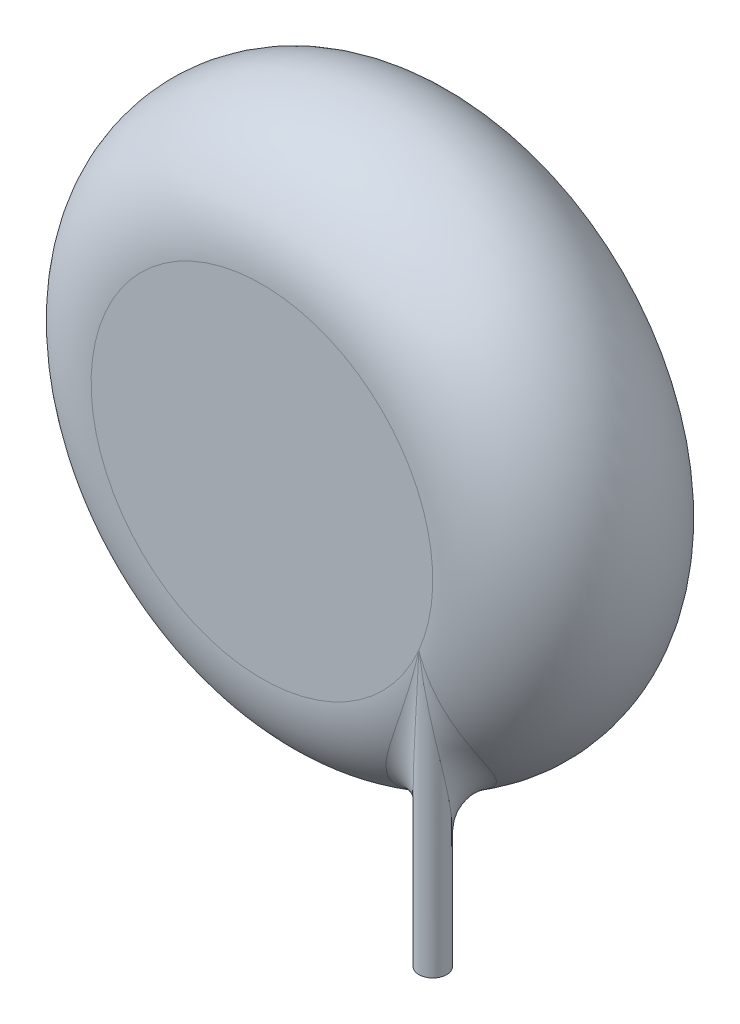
ISO-10303-21;
HEADER;
FILE_DESCRIPTION(('STEP AP214'),'2;1');
FILE_NAME('part.step','',(''),(''),'','','');
FILE_SCHEMA(('AUTOMOTIVE_DESIGN { 1 0 10303 214 1 1 1 1 }'));
ENDSEC;
DATA;
#1=APPLICATION_CONTEXT('core data for automotive mechanical design processes');
#2=APPLICATION_PROTOCOL_DEFINITION('international standard','automotive_design',2000,#1);
#3=PRODUCT_CONTEXT('',#1,'mechanical');
#4=PRODUCT('Part','Part','',(#3));
#5=PRODUCT_RELATED_PRODUCT_CATEGORY('part','',(#4));
#6=PRODUCT_DEFINITION_FORMATION('','',#4);
#7=PRODUCT_DEFINITION_CONTEXT('part definition',#1,'design');
#8=PRODUCT_DEFINITION('design','',#6,#7);
#9=PRODUCT_DEFINITION_SHAPE('','',#8);
#10=(LENGTH_UNIT() NAMED_UNIT(*) SI_UNIT(.MILLI.,.METRE.));
#11=(NAMED_UNIT(*) PLANE_ANGLE_UNIT() SI_UNIT($,.RADIAN.));
#12=(NAMED_UNIT(*) SI_UNIT($,.STERADIAN.) SOLID_ANGLE_UNIT());
#13=UNCERTAINTY_MEASURE_WITH_UNIT(LENGTH_MEASURE(1.E-05),#10,'distance_accuracy_value','');
#14=(GEOMETRIC_REPRESENTATION_CONTEXT(3) GLOBAL_UNCERTAINTY_ASSIGNED_CONTEXT((#13)) GLOBAL_UNIT_ASSIGNED_CONTEXT((#10,
#11,#12)) REPRESENTATION_CONTEXT('',''));
#15=CARTESIAN_POINT('',(0.,0.,0.));
#16=DIRECTION('',(0.,0.,1.));
#17=DIRECTION('',(1.,0.,0.));
#18=AXIS2_PLACEMENT_3D('',#15,#16,#17);
#19=CARTESIAN_POINT('',(-2.25,500000.,-1.35));
#20=DIRECTION('',(0.,-1.,0.));
#21=DIRECTION('',(0.,0.,-1.));
#22=AXIS2_PLACEMENT_3D('',#19,#20,#21);
#23=CYLINDRICAL_SURFACE('',#22,0.2);
#24=CARTESIAN_POINT('',(-2.25,-5.,-1.35));
#25=DIRECTION('',(0.,1.,0.));
#26=DIRECTION('',(0.,0.,1.));
#27=AXIS2_PLACEMENT_3D('',#24,#25,#26);
#28=CIRCLE('',#27,0.2);
#29=CARTESIAN_POINT('',(-2.25,-5.,-1.15));
#30=VERTEX_POINT('',#29);
#31=EDGE_CURVE('E30',#30,#30,#28,.T.);
#32=ORIENTED_EDGE('',*,*,#31,.T.);
#33=EDGE_LOOP('',(#32));
#34=FACE_BOUND('',#33,.T.);
#35=CARTESIAN_POINT('',(-2.25,-0.969535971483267,-1.55));
#36=CARTESIAN_POINT('',(-2.27226713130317,-1.12497943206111,-1.55));
#37=CARTESIAN_POINT('',(-2.2965849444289,-1.27729128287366,-1.54611735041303));
#38=CARTESIAN_POINT('',(-2.3436780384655,-1.57635434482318,-1.52848416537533));
#39=CARTESIAN_POINT('',(-2.36624101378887,-1.72215399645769,-1.51494324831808));
#40=CARTESIAN_POINT('',(-2.40556545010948,-2.013309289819,-1.47852096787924));
#41=CARTESIAN_POINT('',(-2.42214655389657,-2.15767393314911,-1.45567405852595));
#42=CARTESIAN_POINT('',(-2.44471222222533,-2.44060129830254,-1.40374563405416));
#43=CARTESIAN_POINT('',(-2.45082658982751,-2.5814960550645,-1.37420559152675));
#44=CARTESIAN_POINT('',(-2.44898936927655,-2.85464895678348,-1.31366185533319));
#45=CARTESIAN_POINT('',(-2.44096717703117,-2.98951619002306,-1.28209659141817));
#46=CARTESIAN_POINT('',(-2.40920974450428,-3.24664782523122,-1.22457435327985));
#47=CARTESIAN_POINT('',(-2.38507258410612,-3.37200559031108,-1.19796065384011));
#48=CARTESIAN_POINT('',(-2.33773056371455,-3.5454208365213,-1.16932490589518));
#49=CARTESIAN_POINT('',(-2.31984218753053,-3.60169029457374,-1.16154716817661));
#50=CARTESIAN_POINT('',(-2.28151701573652,-3.70546740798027,-1.15150798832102));
#51=CARTESIAN_POINT('',(-2.26053528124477,-3.75448274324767,-1.14910634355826));
#52=CARTESIAN_POINT('',(-2.23025481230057,-3.81391981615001,-1.15078853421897));
#53=CARTESIAN_POINT('',(-2.22143121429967,-3.82998916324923,-1.15185360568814));
#54=CARTESIAN_POINT('',(-2.19419282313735,-3.87544526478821,-1.15705261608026));
#55=CARTESIAN_POINT('',(-2.15697139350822,-3.92618331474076,-1.16945503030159));
#56=CARTESIAN_POINT('',(-2.10588363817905,-3.95137875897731,-1.20656639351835));
#57=CARTESIAN_POINT('',(-2.0696293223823,-3.90786987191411,-1.25708996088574));
#58=CARTESIAN_POINT('',(-2.05779657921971,-3.83890013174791,-1.29212601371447));
#59=CARTESIAN_POINT('',(-2.05286855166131,-3.78158562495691,-1.31553084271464));
#60=CARTESIAN_POINT('',(-2.05183725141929,-3.76394206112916,-1.32217744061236));
#61=CARTESIAN_POINT('',(-2.04940120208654,-3.69911409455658,-1.34488305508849));
#62=CARTESIAN_POINT('',(-2.04976318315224,-3.64756651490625,-1.36002735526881));
#63=CARTESIAN_POINT('',(-2.05310391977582,-3.53895534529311,-1.38777915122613));
#64=CARTESIAN_POINT('',(-2.05612327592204,-3.48098844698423,-1.40060851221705));
#65=CARTESIAN_POINT('',(-2.06753207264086,-3.30293875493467,-1.4354580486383));
#66=CARTESIAN_POINT('',(-2.07819411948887,-3.17769528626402,-1.45423357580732));
#67=CARTESIAN_POINT('',(-2.10162064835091,-2.91817355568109,-1.48551924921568));
#68=CARTESIAN_POINT('',(-2.11424948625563,-2.78603590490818,-1.49774702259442));
#69=CARTESIAN_POINT('',(-2.15218097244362,-2.38261031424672,-1.52737242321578));
#70=CARTESIAN_POINT('',(-2.17741934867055,-2.10420739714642,-1.53765931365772));
#71=CARTESIAN_POINT('',(-2.21994488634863,-1.54329935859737,-1.54894888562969));
#72=CARTESIAN_POINT('',(-2.23744598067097,-1.25875967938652,-1.55));
#73=CARTESIAN_POINT('',(-2.25,-0.969535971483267,-1.55));
#74=(BOUNDED_CURVE() B_SPLINE_CURVE(3,(#35,#36,#37,#38,#39,#40,#41,#42,#43,#44,#45,#46,#47,#48,
#49,#50,#51,#52,#53,#54,#55,#56,#57,#58,#59,#60,#61,#62,#63,#64,#65,#66,#67,#68,#69,#70,#71,#72,
#73),.UNSPECIFIED.,.T.,.F.) B_SPLINE_CURVE_WITH_KNOTS((4,2,2,2,2,2,2,2,2,2,1,1,1,2,2,2,2,2,2,2,
4),(-0.00344219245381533,-0.00292054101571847,-0.00239888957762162,-0.00187723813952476,
-0.00135558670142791,-0.000833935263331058,-0.000312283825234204,-5.14581061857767E-05,
0.00020936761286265,0.000313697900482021,0.000529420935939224,0.000745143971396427,
0.00096086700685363,0.00117659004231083,0.00126436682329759,0.0014838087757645,
0.0017032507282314,0.00214213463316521,0.00258101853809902,0.00345878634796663,
0.00433655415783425),
.UNSPECIFIED.) CURVE() GEOMETRIC_REPRESENTATION_ITEM() RATIONAL_B_SPLINE_CURVE((1.,1.,1.,1.,1.,
1.,1.,1.,1.,1.,1.,1.,1.,1.,1.,1.,1.,1.,1.,1.,0.999999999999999,1.,1.,1.,1.,1.,1.,1.,1.,1.,1.,1.,
1.,1.,1.,1.,1.,1.,1.)) REPRESENTATION_ITEM(''));
#75=CARTESIAN_POINT('',(-2.25,-0.969535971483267,-1.55));
#76=VERTEX_POINT('',#75);
#77=CARTESIAN_POINT('',(-2.25,-3.7744786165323,-1.15));
#78=VERTEX_POINT('',#77);
#79=EDGE_CURVE('E11',#76,#78,#74,.F.);
#80=ORIENTED_EDGE('',*,*,#79,.T.);
#81=CARTESIAN_POINT('',(-2.25,-0.969535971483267,-1.55));
#82=CARTESIAN_POINT('',(-2.27226713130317,-1.12497943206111,-1.55));
#83=CARTESIAN_POINT('',(-2.2965849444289,-1.27729128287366,-1.54611735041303));
#84=CARTESIAN_POINT('',(-2.3436780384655,-1.57635434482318,-1.52848416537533));
#85=CARTESIAN_POINT('',(-2.36624101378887,-1.72215399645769,-1.51494324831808));
#86=CARTESIAN_POINT('',(-2.40556545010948,-2.013309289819,-1.47852096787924));
#87=CARTESIAN_POINT('',(-2.42214655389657,-2.15767393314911,-1.45567405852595));
#88=CARTESIAN_POINT('',(-2.44471222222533,-2.44060129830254,-1.40374563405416));
#89=CARTESIAN_POINT('',(-2.45082658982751,-2.5814960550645,-1.37420559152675));
#90=CARTESIAN_POINT('',(-2.44898936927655,-2.85464895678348,-1.31366185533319));
#91=CARTESIAN_POINT('',(-2.44096717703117,-2.98951619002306,-1.28209659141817));
#92=CARTESIAN_POINT('',(-2.40920974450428,-3.24664782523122,-1.22457435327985));
#93=CARTESIAN_POINT('',(-2.38507258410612,-3.37200559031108,-1.19796065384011));
#94=CARTESIAN_POINT('',(-2.33773056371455,-3.5454208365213,-1.16932490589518));
#95=CARTESIAN_POINT('',(-2.31984218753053,-3.60169029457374,-1.16154716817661));
#96=CARTESIAN_POINT('',(-2.28151701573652,-3.70546740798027,-1.15150798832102));
#97=CARTESIAN_POINT('',(-2.26053528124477,-3.75448274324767,-1.14910634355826));
#98=CARTESIAN_POINT('',(-2.23025481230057,-3.81391981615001,-1.15078853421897));
#99=CARTESIAN_POINT('',(-2.22143121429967,-3.82998916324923,-1.15185360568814));
#100=CARTESIAN_POINT('',(-2.19419282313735,-3.87544526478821,-1.15705261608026));
#101=CARTESIAN_POINT('',(-2.15697139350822,-3.92618331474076,-1.16945503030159));
#102=CARTESIAN_POINT('',(-2.10588363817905,-3.95137875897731,-1.20656639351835));
#103=CARTESIAN_POINT('',(-2.0696293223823,-3.90786987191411,-1.25708996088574));
#104=CARTESIAN_POINT('',(-2.05779657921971,-3.83890013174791,-1.29212601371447));
#105=CARTESIAN_POINT('',(-2.05286855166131,-3.78158562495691,-1.31553084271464));
#106=CARTESIAN_POINT('',(-2.05183725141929,-3.76394206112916,-1.32217744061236));
#107=CARTESIAN_POINT('',(-2.04940120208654,-3.69911409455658,-1.34488305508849));
#108=CARTESIAN_POINT('',(-2.04976318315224,-3.64756651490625,-1.36002735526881));
#109=CARTESIAN_POINT('',(-2.05310391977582,-3.53895534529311,-1.38777915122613));
#110=CARTESIAN_POINT('',(-2.05612327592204,-3.48098844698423,-1.40060851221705));
#111=CARTESIAN_POINT('',(-2.06753207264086,-3.30293875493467,-1.4354580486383));
#112=CARTESIAN_POINT('',(-2.07819411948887,-3.17769528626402,-1.45423357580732));
#113=CARTESIAN_POINT('',(-2.10162064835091,-2.91817355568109,-1.48551924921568));
#114=CARTESIAN_POINT('',(-2.11424948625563,-2.78603590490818,-1.49774702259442));
#115=CARTESIAN_POINT('',(-2.15218097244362,-2.38261031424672,-1.52737242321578));
#116=CARTESIAN_POINT('',(-2.17741934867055,-2.10420739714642,-1.53765931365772));
#117=CARTESIAN_POINT('',(-2.21994488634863,-1.54329935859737,-1.54894888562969));
#118=CARTESIAN_POINT('',(-2.23744598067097,-1.25875967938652,-1.55));
#119=CARTESIAN_POINT('',(-2.25,-0.969535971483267,-1.55));
#120=(BOUNDED_CURVE() B_SPLINE_CURVE(3,(#81,#82,#83,#84,#85,#86,#87,#88,#89,#90,#91,#92,#93,#94,
#95,#96,#97,#98,#99,#100,#101,#102,#103,#104,#105,#106,#107,#108,#109,#110,#111,#112,#113,#114,
#115,#116,#117,#118,#119),.UNSPECIFIED.,.T.,.F.) B_SPLINE_CURVE_WITH_KNOTS((4,2,2,2,2,2,2,2,2,2,
1,1,1,2,2,2,2,2,2,2,4),(-0.00344219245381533,-0.00292054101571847,-0.00239888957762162,
-0.00187723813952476,-0.00135558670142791,-0.000833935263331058,-0.000312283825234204,
-5.14581061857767E-05,0.00020936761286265,0.000313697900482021,0.000529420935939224,
0.000745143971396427,0.00096086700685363,0.00117659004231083,0.00126436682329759,
0.0014838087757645,0.0017032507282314,0.00214213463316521,0.00258101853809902,
0.00345878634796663,0.00433655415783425),
.UNSPECIFIED.) CURVE() GEOMETRIC_REPRESENTATION_ITEM() RATIONAL_B_SPLINE_CURVE((1.,1.,1.,1.,1.,
1.,1.,1.,1.,1.,1.,1.,1.,1.,1.,1.,1.,1.,1.,1.,0.999999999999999,1.,1.,1.,1.,1.,1.,1.,1.,1.,1.,1.,
1.,1.,1.,1.,1.,1.,1.)) REPRESENTATION_ITEM(''));
#121=EDGE_CURVE('E121',#78,#76,#120,.F.);
#122=ORIENTED_EDGE('',*,*,#121,.T.);
#123=EDGE_LOOP('',(#80,#122));
#124=FACE_BOUND('',#123,.T.);
#125=ADVANCED_FACE('F17',(#34,#124),#23,.T.);
#126=CARTESIAN_POINT('',(2.25,500000.,1.35));
#127=DIRECTION('',(0.,-1.,0.));
#128=DIRECTION('',(0.,0.,-1.));
#129=AXIS2_PLACEMENT_3D('',#126,#127,#128);
#130=CYLINDRICAL_SURFACE('',#129,0.2);
#131=CARTESIAN_POINT('',(2.25,-5.,1.35));
#132=DIRECTION('',(0.,1.,0.));
#133=DIRECTION('',(0.,0.,1.));
#134=AXIS2_PLACEMENT_3D('',#131,#132,#133);
#135=CIRCLE('',#134,0.2);
#136=CARTESIAN_POINT('',(2.25,-5.,1.55));
#137=VERTEX_POINT('',#136);
#138=EDGE_CURVE('E177',#137,#137,#135,.T.);
#139=ORIENTED_EDGE('',*,*,#138,.T.);
#140=EDGE_LOOP('',(#139));
#141=FACE_BOUND('',#140,.T.);
#142=CARTESIAN_POINT('',(2.25,-0.969535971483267,1.55));
#143=CARTESIAN_POINT('',(2.29485859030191,-1.28268697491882,1.55));
#144=CARTESIAN_POINT('',(2.34622059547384,-1.57404722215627,1.53344354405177));
#145=CARTESIAN_POINT('',(2.405617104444,-2.0136304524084,1.47849436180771));
#146=CARTESIAN_POINT('',(2.42200199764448,-2.15616312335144,1.45593424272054));
#147=CARTESIAN_POINT('',(2.44469505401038,-2.44008655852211,1.40385709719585));
#148=CARTESIAN_POINT('',(2.45080204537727,-2.58025844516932,1.37447240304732));
#149=CARTESIAN_POINT('',(2.44902668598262,-2.85395322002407,1.31382351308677));
#150=CARTESIAN_POINT('',(2.44111340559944,-2.98826676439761,1.28237749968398));
#151=CARTESIAN_POINT('',(2.40910873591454,-3.24753102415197,1.22437537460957));
#152=CARTESIAN_POINT('',(2.38532196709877,-3.37115028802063,1.19809237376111));
#153=CARTESIAN_POINT('',(2.33749297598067,-3.54626192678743,1.1691907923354));
#154=CARTESIAN_POINT('',(2.31997337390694,-3.60131380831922,1.16158993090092));
#155=CARTESIAN_POINT('',(2.28154375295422,-3.7054161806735,1.15150662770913));
#156=CARTESIAN_POINT('',(2.26060031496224,-3.75433490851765,1.14911188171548));
#157=CARTESIAN_POINT('',(2.23034659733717,-3.81374767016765,1.15077979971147));
#158=CARTESIAN_POINT('',(2.22153165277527,-3.82981894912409,1.15183569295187));
#159=CARTESIAN_POINT('',(2.19424468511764,-3.87539420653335,1.15702642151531));
#160=CARTESIAN_POINT('',(2.15665339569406,-3.92656424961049,1.16958704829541));
#161=CARTESIAN_POINT('',(2.10572056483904,-3.95125905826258,1.20676730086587));
#162=CARTESIAN_POINT('',(2.06958694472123,-3.90775468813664,1.25717139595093));
#163=CARTESIAN_POINT('',(2.05771873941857,-3.83846600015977,1.29234922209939));
#164=CARTESIAN_POINT('',(2.05281935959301,-3.7809653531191,1.31577918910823));
#165=CARTESIAN_POINT('',(2.05179718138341,-3.76320405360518,1.32245138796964));
#166=CARTESIAN_POINT('',(2.04937870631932,-3.69766494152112,1.34535055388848));
#167=CARTESIAN_POINT('',(2.04977155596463,-3.64623837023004,1.36041828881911));
#168=CARTESIAN_POINT('',(2.05322951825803,-3.53597013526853,1.38848828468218));
#169=CARTESIAN_POINT('',(2.05626303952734,-3.47858197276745,1.4011098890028));
#170=CARTESIAN_POINT('',(2.06761706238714,-3.30207398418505,1.43556510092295));
#171=CARTESIAN_POINT('',(2.07816687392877,-3.17803225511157,1.45417723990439));
#172=CARTESIAN_POINT('',(2.10150125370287,-2.91946130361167,1.48537962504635));
#173=CARTESIAN_POINT('',(2.11421427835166,-2.78640838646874,1.49771666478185));
#174=CARTESIAN_POINT('',(2.15218509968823,-2.38257036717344,1.52738135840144));
#175=CARTESIAN_POINT('',(2.17741146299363,-2.10429993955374,1.53765637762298));
#176=CARTESIAN_POINT('',(2.2199384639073,-1.54339553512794,1.54894802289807));
#177=CARTESIAN_POINT('',(2.23743828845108,-1.25893683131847,1.55));
#178=CARTESIAN_POINT('',(2.25,-0.969535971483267,1.55));
#179=(BOUNDED_CURVE() B_SPLINE_CURVE(3,(#142,#143,#144,#145,#146,#147,#148,#149,#150,#151,#152,
#153,#154,#155,#156,#157,#158,#159,#160,#161,#162,#163,#164,#165,#166,#167,#168,#169,#170,#171,
#172,#173,#174,#175,#176,#177,#178),.UNSPECIFIED.,.T.,.F.) B_SPLINE_CURVE_WITH_KNOTS((4,2,2,2,2,
2,2,2,2,1,1,1,2,2,2,2,2,2,2,4),(-0.00309701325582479,-0.00205393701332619,-0.00153239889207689,
-0.00101086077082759,-0.000489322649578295,3.22154716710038E-05,0.000292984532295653,
0.000553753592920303,0.000658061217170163,0.000874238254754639,0.00109041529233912,
0.00130659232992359,0.00152276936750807,0.00161100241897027,0.00183158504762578,
0.00205216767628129,0.0024933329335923,0.00293449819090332,0.00381682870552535,
0.00469915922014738),
.UNSPECIFIED.) CURVE() GEOMETRIC_REPRESENTATION_ITEM() RATIONAL_B_SPLINE_CURVE((1.,1.,1.,1.,1.,
1.,1.,1.,1.,1.,1.,1.,1.,1.,1.,1.,1.,1.,1.,1.,1.,1.,1.,1.,1.,1.,1.,1.,1.,1.,1.,1.,1.,1.,1.,1.,1.)) REPRESENTATION_ITEM(''));
#180=CARTESIAN_POINT('',(2.25,-3.7744786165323,1.15));
#181=VERTEX_POINT('',#180);
#182=CARTESIAN_POINT('',(2.25,-0.969535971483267,1.55));
#183=VERTEX_POINT('',#182);
#184=EDGE_CURVE('E169',#181,#183,#179,.F.);
#185=ORIENTED_EDGE('',*,*,#184,.T.);
#186=CARTESIAN_POINT('',(2.25,-0.969535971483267,1.55));
#187=CARTESIAN_POINT('',(2.29485859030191,-1.28268697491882,1.55));
#188=CARTESIAN_POINT('',(2.34622059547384,-1.57404722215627,1.53344354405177));
#189=CARTESIAN_POINT('',(2.405617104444,-2.0136304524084,1.47849436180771));
#190=CARTESIAN_POINT('',(2.42200199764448,-2.15616312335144,1.45593424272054));
#191=CARTESIAN_POINT('',(2.44469505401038,-2.44008655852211,1.40385709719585));
#192=CARTESIAN_POINT('',(2.45080204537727,-2.58025844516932,1.37447240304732));
#193=CARTESIAN_POINT('',(2.44902668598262,-2.85395322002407,1.31382351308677));
#194=CARTESIAN_POINT('',(2.44111340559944,-2.98826676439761,1.28237749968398));
#195=CARTESIAN_POINT('',(2.40910873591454,-3.24753102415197,1.22437537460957));
#196=CARTESIAN_POINT('',(2.38532196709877,-3.37115028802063,1.19809237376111));
#197=CARTESIAN_POINT('',(2.33749297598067,-3.54626192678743,1.1691907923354));
#198=CARTESIAN_POINT('',(2.31997337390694,-3.60131380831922,1.16158993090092));
#199=CARTESIAN_POINT('',(2.28154375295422,-3.7054161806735,1.15150662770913));
#200=CARTESIAN_POINT('',(2.26060031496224,-3.75433490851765,1.14911188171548));
#201=CARTESIAN_POINT('',(2.23034659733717,-3.81374767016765,1.15077979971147));
#202=CARTESIAN_POINT('',(2.22153165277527,-3.82981894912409,1.15183569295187));
#203=CARTESIAN_POINT('',(2.19424468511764,-3.87539420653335,1.15702642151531));
#204=CARTESIAN_POINT('',(2.15665339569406,-3.92656424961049,1.16958704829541));
#205=CARTESIAN_POINT('',(2.10572056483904,-3.95125905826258,1.20676730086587));
#206=CARTESIAN_POINT('',(2.06958694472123,-3.90775468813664,1.25717139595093));
#207=CARTESIAN_POINT('',(2.05771873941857,-3.83846600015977,1.29234922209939));
#208=CARTESIAN_POINT('',(2.05281935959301,-3.7809653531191,1.31577918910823));
#209=CARTESIAN_POINT('',(2.05179718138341,-3.76320405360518,1.32245138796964));
#210=CARTESIAN_POINT('',(2.04937870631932,-3.69766494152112,1.34535055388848));
#211=CARTESIAN_POINT('',(2.04977155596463,-3.64623837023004,1.36041828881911));
#212=CARTESIAN_POINT('',(2.05322951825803,-3.53597013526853,1.38848828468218));
#213=CARTESIAN_POINT('',(2.05626303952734,-3.47858197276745,1.4011098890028));
#214=CARTESIAN_POINT('',(2.06761706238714,-3.30207398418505,1.43556510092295));
#215=CARTESIAN_POINT('',(2.07816687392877,-3.17803225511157,1.45417723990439));
#216=CARTESIAN_POINT('',(2.10150125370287,-2.91946130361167,1.48537962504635));
#217=CARTESIAN_POINT('',(2.11421427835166,-2.78640838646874,1.49771666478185));
#218=CARTESIAN_POINT('',(2.15218509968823,-2.38257036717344,1.52738135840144));
#219=CARTESIAN_POINT('',(2.17741146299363,-2.10429993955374,1.53765637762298));
#220=CARTESIAN_POINT('',(2.2199384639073,-1.54339553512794,1.54894802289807));
#221=CARTESIAN_POINT('',(2.23743828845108,-1.25893683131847,1.55));
#222=CARTESIAN_POINT('',(2.25,-0.969535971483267,1.55));
#223=(BOUNDED_CURVE() B_SPLINE_CURVE(3,(#186,#187,#188,#189,#190,#191,#192,#193,#194,#195,#196,
#197,#198,#199,#200,#201,#202,#203,#204,#205,#206,#207,#208,#209,#210,#211,#212,#213,#214,#215,
#216,#217,#218,#219,#220,#221,#222),.UNSPECIFIED.,.T.,.F.) B_SPLINE_CURVE_WITH_KNOTS((4,2,2,2,2,
2,2,2,2,1,1,1,2,2,2,2,2,2,2,4),(-0.00309701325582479,-0.00205393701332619,-0.00153239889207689,
-0.00101086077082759,-0.000489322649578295,3.22154716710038E-05,0.000292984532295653,
0.000553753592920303,0.000658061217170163,0.000874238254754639,0.00109041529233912,
0.00130659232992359,0.00152276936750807,0.00161100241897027,0.00183158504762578,
0.00205216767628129,0.0024933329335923,0.00293449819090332,0.00381682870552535,
0.00469915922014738),
.UNSPECIFIED.) CURVE() GEOMETRIC_REPRESENTATION_ITEM() RATIONAL_B_SPLINE_CURVE((1.,1.,1.,1.,1.,
1.,1.,1.,1.,1.,1.,1.,1.,1.,1.,1.,1.,1.,1.,1.,1.,1.,1.,1.,1.,1.,1.,1.,1.,1.,1.,1.,1.,1.,1.,1.,1.)) REPRESENTATION_ITEM(''));
#224=EDGE_CURVE('E77',#183,#181,#223,.F.);
#225=ORIENTED_EDGE('',*,*,#224,.T.);
#226=EDGE_LOOP('',(#185,#225));
#227=FACE_BOUND('',#226,.T.);
#228=ADVANCED_FACE('F143',(#141,#227),#130,.T.);
#229=CARTESIAN_POINT('',(0.,0.,0.));
#230=DIRECTION('',(0.,0.,1.));
#231=DIRECTION('',(1.,0.,0.));
#232=AXIS2_PLACEMENT_3D('',#229,#230,#231);
#233=TOROIDAL_SURFACE('',#232,2.45,1.55);
#234=CARTESIAN_POINT('',(0.,0.,1.55));
#235=DIRECTION('',(0.,0.,1.));
#236=DIRECTION('',(1.,0.,0.));
#237=AXIS2_PLACEMENT_3D('',#234,#235,#236);
#238=CIRCLE('',#237,2.45);
#239=EDGE_CURVE('E66',#183,#183,#238,.T.);
#240=ORIENTED_EDGE('',*,*,#239,.F.);
#241=CARTESIAN_POINT('',(1.7294161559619,-3.49573130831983,0.547381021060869));
#242=CARTESIAN_POINT('',(1.73649271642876,-3.49351017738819,0.544345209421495));
#243=CARTESIAN_POINT('',(1.7435948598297,-3.49118267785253,0.541448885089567));
#244=CARTESIAN_POINT('',(1.75787398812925,-3.48631591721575,0.535912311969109));
#245=CARTESIAN_POINT('',(1.76505117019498,-3.48377560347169,0.53327349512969));
#246=CARTESIAN_POINT('',(1.77946326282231,-3.47849539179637,0.528248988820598));
#247=CARTESIAN_POINT('',(1.78669828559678,-3.47575460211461,0.525864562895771));
#248=CARTESIAN_POINT('',(1.80120946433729,-3.47008525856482,0.521345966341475));
#249=CARTESIAN_POINT('',(1.80848566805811,-3.46715598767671,0.519212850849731));
#250=CARTESIAN_POINT('',(1.82306245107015,-3.46112158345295,0.515194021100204));
#251=CARTESIAN_POINT('',(1.83036303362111,-3.45801591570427,0.513309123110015));
#252=CARTESIAN_POINT('',(1.84497183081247,-3.45164057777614,0.509783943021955));
#253=CARTESIAN_POINT('',(1.85228002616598,-3.44837055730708,0.508144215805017));
#254=CARTESIAN_POINT('',(1.86688728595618,-3.44167842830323,0.505106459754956));
#255=CARTESIAN_POINT('',(1.87418633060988,-3.43825615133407,0.503708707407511));
#256=CARTESIAN_POINT('',(1.88876037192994,-3.4312703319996,0.501152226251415));
#257=CARTESIAN_POINT('',(1.89603536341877,-3.42770676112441,0.499993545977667));
#258=CARTESIAN_POINT('',(1.91055504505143,-3.42044638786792,0.497905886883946));
#259=CARTESIAN_POINT('',(1.91779972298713,-3.41674953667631,0.496976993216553));
#260=CARTESIAN_POINT('',(1.93224762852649,-3.40923214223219,0.495343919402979));
#261=CARTESIAN_POINT('',(1.93945086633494,-3.40541163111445,0.494639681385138));
#262=CARTESIAN_POINT('',(1.95380385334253,-3.39765696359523,0.493450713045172));
#263=CARTESIAN_POINT('',(1.96095365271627,-3.39372293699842,0.492965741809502));
#264=CARTESIAN_POINT('',(1.97519619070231,-3.38574625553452,0.49220992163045));
#265=CARTESIAN_POINT('',(1.98228896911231,-3.3817036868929,0.491938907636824));
#266=CARTESIAN_POINT('',(2.0035091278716,-3.36940112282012,0.49143468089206));
#267=CARTESIAN_POINT('',(2.01755213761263,-3.36098043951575,0.491512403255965));
#268=CARTESIAN_POINT('',(2.04539005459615,-3.34374537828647,0.492444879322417));
#269=CARTESIAN_POINT('',(2.05918462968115,-3.33493052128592,0.493300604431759));
#270=CARTESIAN_POINT('',(2.08646500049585,-3.31695899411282,0.495743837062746));
#271=CARTESIAN_POINT('',(2.09995106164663,-3.30780263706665,0.497330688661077));
#272=CARTESIAN_POINT('',(2.12655182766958,-3.28920082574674,0.501191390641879));
#273=CARTESIAN_POINT('',(2.13966764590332,-3.27975646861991,0.503462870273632));
#274=CARTESIAN_POINT('',(2.16546859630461,-3.26062975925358,0.508647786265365));
#275=CARTESIAN_POINT('',(2.1781558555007,-3.25094919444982,0.511557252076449));
#276=CARTESIAN_POINT('',(2.20309048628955,-3.23137738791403,0.517962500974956));
#277=CARTESIAN_POINT('',(2.2153400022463,-3.221487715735,0.521454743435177));
#278=CARTESIAN_POINT('',(2.23940563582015,-3.20149167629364,0.529002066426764));
#279=CARTESIAN_POINT('',(2.25122313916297,-3.19138620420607,0.533055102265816));
#280=CARTESIAN_POINT('',(2.27443499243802,-3.17095443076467,0.541695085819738));
#281=CARTESIAN_POINT('',(2.28582988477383,-3.1606284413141,0.546281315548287));
#282=CARTESIAN_POINT('',(2.3082057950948,-3.13975088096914,0.555961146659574));
#283=CARTESIAN_POINT('',(2.31918650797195,-3.12919915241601,0.561055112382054));
#284=CARTESIAN_POINT('',(2.3406918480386,-3.10791674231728,0.571695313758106));
#285=CARTESIAN_POINT('',(2.35121746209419,-3.09718652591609,0.577240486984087));
#286=CARTESIAN_POINT('',(2.37173848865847,-3.07561762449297,0.588722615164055));
#287=CARTESIAN_POINT('',(2.3817374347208,-3.06478046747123,0.594656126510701));
#288=CARTESIAN_POINT('',(2.40120848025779,-3.0430005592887,0.606888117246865));
#289=CARTESIAN_POINT('',(2.41068375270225,-3.03205906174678,0.613183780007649));
#290=CARTESIAN_POINT('',(2.42911166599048,-3.01007236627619,0.626112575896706));
#291=CARTESIAN_POINT('',(2.43806710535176,-2.99902818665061,0.632743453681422));
#292=CARTESIAN_POINT('',(2.45545947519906,-2.9768380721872,0.646315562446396));
#293=CARTESIAN_POINT('',(2.46389885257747,-2.96569296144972,0.65325500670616));
#294=CARTESIAN_POINT('',(2.48026321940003,-2.94330286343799,0.667417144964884));
#295=CARTESIAN_POINT('',(2.4881903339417,-2.93205854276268,0.674638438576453));
#296=CARTESIAN_POINT('',(2.50353421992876,-2.90947187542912,0.68933729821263));
#297=CARTESIAN_POINT('',(2.51095283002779,-2.89813006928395,0.696813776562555));
#298=CARTESIAN_POINT('',(2.52528383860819,-2.87535024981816,0.71199601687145));
#299=CARTESIAN_POINT('',(2.53219782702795,-2.86391267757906,0.719700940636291));
#300=CARTESIAN_POINT('',(2.54552320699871,-2.84094312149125,0.735313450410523));
#301=CARTESIAN_POINT('',(2.55193598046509,-2.82941150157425,0.743220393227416));
#302=CARTESIAN_POINT('',(2.56426298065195,-2.80625801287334,0.759207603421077));
#303=CARTESIAN_POINT('',(2.57017851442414,-2.79463647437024,0.767287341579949));
#304=CARTESIAN_POINT('',(2.58149652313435,-2.77132369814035,0.783584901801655));
#305=CARTESIAN_POINT('',(2.58690100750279,-2.75963294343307,0.79180201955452));
#306=CARTESIAN_POINT('',(2.59720283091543,-2.73619041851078,0.808349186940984));
#307=CARTESIAN_POINT('',(2.60210217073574,-2.72443909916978,0.816678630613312));
#308=CARTESIAN_POINT('',(2.61140191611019,-2.7008789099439,0.833428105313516));
#309=CARTESIAN_POINT('',(2.61580415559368,-2.68907043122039,0.841847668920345));
#310=CARTESIAN_POINT('',(2.62411796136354,-2.66539952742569,0.858755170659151));
#311=CARTESIAN_POINT('',(2.6280312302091,-2.65353744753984,0.867242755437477));
#312=CARTESIAN_POINT('',(2.63537529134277,-2.62976289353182,0.884264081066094));
#313=CARTESIAN_POINT('',(2.6388076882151,-2.61785073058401,0.892797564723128));
#314=CARTESIAN_POINT('',(2.6451981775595,-2.59397955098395,0.909888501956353));
#315=CARTESIAN_POINT('',(2.64815780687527,-2.58202082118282,0.918445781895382));
#316=CARTESIAN_POINT('',(2.65361087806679,-2.55806007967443,0.935562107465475));
#317=CARTESIAN_POINT('',(2.65610581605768,-2.54605833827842,0.944121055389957));
#318=CARTESIAN_POINT('',(2.66063766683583,-2.522014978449,0.961218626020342));
#319=CARTESIAN_POINT('',(2.6626760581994,-2.50997362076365,0.969757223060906));
#320=CARTESIAN_POINT('',(2.66630267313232,-2.48585502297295,0.9867916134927));
#321=CARTESIAN_POINT('',(2.66789237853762,-2.47377803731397,0.995287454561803));
#322=CARTESIAN_POINT('',(2.67199586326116,-2.43752843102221,1.02065648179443));
#323=CARTESIAN_POINT('',(2.67386159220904,-2.4132433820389,1.03747817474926));
#324=CARTESIAN_POINT('',(2.67593491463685,-2.36449961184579,1.07078143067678));
#325=CARTESIAN_POINT('',(2.67614827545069,-2.34004179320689,1.08726397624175));
#326=CARTESIAN_POINT('',(2.67501648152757,-2.29096265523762,1.11977079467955));
#327=CARTESIAN_POINT('',(2.67367588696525,-2.26634202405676,1.13579626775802));
#328=CARTESIAN_POINT('',(2.6695373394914,-2.2169507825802,1.1672705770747));
#329=CARTESIAN_POINT('',(2.6667433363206,-2.19218075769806,1.18272085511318));
#330=CARTESIAN_POINT('',(2.65979110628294,-2.14250301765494,1.21291911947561));
#331=CARTESIAN_POINT('',(2.65563675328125,-2.11759588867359,1.22766896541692));
#332=CARTESIAN_POINT('',(2.64609455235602,-2.06769395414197,1.25635210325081));
#333=CARTESIAN_POINT('',(2.64071200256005,-2.04269996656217,1.27028858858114));
#334=CARTESIAN_POINT('',(2.6288228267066,-1.99258638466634,1.2972934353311));
#335=CARTESIAN_POINT('',(2.62231871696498,-1.9674671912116,1.31036365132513));
#336=CARTESIAN_POINT('',(2.60828606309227,-1.91703030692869,1.33559953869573));
#337=CARTESIAN_POINT('',(2.6007565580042,-1.89171245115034,1.34776434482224));
#338=CARTESIAN_POINT('',(2.58477237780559,-1.84080577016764,1.3711534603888));
#339=CARTESIAN_POINT('',(2.57631419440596,-1.81521627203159,1.38237389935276));
#340=CARTESIAN_POINT('',(2.55858842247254,-1.76373513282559,1.40382716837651));
#341=CARTESIAN_POINT('',(2.54931692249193,-1.73784261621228,1.41405466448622));
#342=CARTESIAN_POINT('',(2.53012853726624,-1.68593481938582,1.4333498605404));
#343=CARTESIAN_POINT('',(2.52021304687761,-1.65991991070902,1.4424199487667));
#344=CARTESIAN_POINT('',(2.49988266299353,-1.60772791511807,1.45940887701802));
#345=CARTESIAN_POINT('',(2.4894680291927,-1.58155091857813,1.46732830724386));
#346=CARTESIAN_POINT('',(2.46826397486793,-1.52894618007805,1.48204055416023));
#347=CARTESIAN_POINT('',(2.45747362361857,-1.50251795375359,1.48883029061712));
#348=CARTESIAN_POINT('',(2.43564287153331,-1.44932258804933,1.50130903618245));
#349=CARTESIAN_POINT('',(2.42460139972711,-1.42255437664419,1.50699158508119));
#350=CARTESIAN_POINT('',(2.40239176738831,-1.36859080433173,1.51728108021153));
#351=CARTESIAN_POINT('',(2.39122332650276,-1.34139374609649,1.52187849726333));
#352=CARTESIAN_POINT('',(2.36888241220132,-1.28648430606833,1.53002258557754));
#353=CARTESIAN_POINT('',(2.35771128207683,-1.25876955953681,1.53355697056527));
#354=CARTESIAN_POINT('',(2.33548649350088,-1.20273674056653,1.53959953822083));
#355=CARTESIAN_POINT('',(2.32443654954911,-1.17441560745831,1.54209297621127));
#356=CARTESIAN_POINT('',(2.30257626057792,-1.11708165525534,1.54607760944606));
#357=CARTESIAN_POINT('',(2.29177271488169,-1.08806507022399,1.54755188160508));
#358=CARTESIAN_POINT('',(2.27052167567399,-1.02925349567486,1.54952281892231));
#359=CARTESIAN_POINT('',(2.26008462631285,-0.999454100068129,1.55000067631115));
#360=CARTESIAN_POINT('',(2.25,-0.969535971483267,1.55));
#361=B_SPLINE_CURVE_WITH_KNOTS('',3,(#241,#242,#243,#244,#245,#246,#247,#248,#249,#250,#251,
#252,#253,#254,#255,#256,#257,#258,#259,#260,#261,#262,#263,#264,#265,#266,#267,#268,#269,#270,
#271,#272,#273,#274,#275,#276,#277,#278,#279,#280,#281,#282,#283,#284,#285,#286,#287,#288,#289,
#290,#291,#292,#293,#294,#295,#296,#297,#298,#299,#300,#301,#302,#303,#304,#305,#306,#307,#308,
#309,#310,#311,#312,#313,#314,#315,#316,#317,#318,#319,#320,#321,#322,#323,#324,#325,#326,#327,
#328,#329,#330,#331,#332,#333,#334,#335,#336,#337,#338,#339,#340,#341,#342,#343,#344,#345,#346,
#347,#348,#349,#350,#351,#352,#353,#354,#355,#356,#357,#358,#359,#360),.UNSPECIFIED.,.F.,.F.,(4,
2,2,2,2,2,2,2,2,2,2,2,2,2,2,2,2,2,2,2,2,2,2,2,2,2,2,2,2,2,2,2,2,2,2,2,2,2,2,2,2,2,2,2,2,2,2,2,2,
2,2,2,2,2,2,2,2,2,2,4),(0.,0.0240395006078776,0.048205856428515,0.0724871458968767,
0.0968669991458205,0.121325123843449,0.145837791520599,0.170378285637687,0.194923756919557,
0.21947831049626,0.244026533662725,0.268547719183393,0.29304997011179,0.342143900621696,
0.39129921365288,0.440410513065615,0.489353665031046,0.538000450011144,0.586361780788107,
0.634551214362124,0.682676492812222,0.730836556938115,0.778886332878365,0.826556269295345,
0.873895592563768,0.920950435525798,0.967761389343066,1.01436369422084,1.0607874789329,
1.10705804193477,1.15319616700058,1.19920895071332,1.24503255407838,1.29066705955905,
1.33612729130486,1.3814245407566,1.42656684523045,1.47155927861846,1.51640425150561,
1.56110181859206,1.60564999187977,1.69439714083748,1.78283439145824,1.87101277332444,
1.95895276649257,2.04664447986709,2.13396483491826,2.22109176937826,2.30830092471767,
2.39585167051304,2.48384934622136,2.57166239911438,2.65943025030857,2.7474336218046,
2.83593603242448,2.92518890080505,3.01543685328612,3.10692299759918,3.19989395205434,
3.29460445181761),.UNSPECIFIED.);
#362=CARTESIAN_POINT('',(1.72941557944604,-3.49573012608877,0.547380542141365));
#363=VERTEX_POINT('',#362);
#364=EDGE_CURVE('E59',#183,#363,#361,.F.);
#365=ORIENTED_EDGE('',*,*,#364,.T.);
#366=CARTESIAN_POINT('',(2.25,-0.969535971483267,1.55));
#367=CARTESIAN_POINT('',(2.23810263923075,-1.02498124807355,1.54999796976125));
#368=CARTESIAN_POINT('',(2.22529152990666,-1.08022815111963,1.54989254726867));
#369=CARTESIAN_POINT('',(2.19812082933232,-1.1896024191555,1.54931375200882));
#370=CARTESIAN_POINT('',(2.18378268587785,-1.24373513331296,1.54884501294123));
#371=CARTESIAN_POINT('',(2.15371803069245,-1.35089082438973,1.54739543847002));
#372=CARTESIAN_POINT('',(2.13801067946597,-1.40391927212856,1.54642094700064));
#373=CARTESIAN_POINT('',(2.1053695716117,-1.50887831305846,1.54381292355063));
#374=CARTESIAN_POINT('',(2.08845292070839,-1.56081443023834,1.5421874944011));
#375=CARTESIAN_POINT('',(2.05355608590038,-1.66360082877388,1.53813056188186));
#376=CARTESIAN_POINT('',(2.03559110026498,-1.71445666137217,1.53570896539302));
#377=CARTESIAN_POINT('',(1.99873544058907,-1.81514195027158,1.52991262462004));
#378=CARTESIAN_POINT('',(1.97985711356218,-1.8649765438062,1.52654865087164));
#379=CARTESIAN_POINT('',(1.9413833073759,-1.9636617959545,1.51866630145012));
#380=CARTESIAN_POINT('',(1.92179762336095,-2.01251727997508,1.51416061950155));
#381=CARTESIAN_POINT('',(1.88215677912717,-2.10919819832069,1.50379077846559));
#382=CARTESIAN_POINT('',(1.86211015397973,-2.15702894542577,1.49794369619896));
#383=CARTESIAN_POINT('',(1.82179317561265,-2.25161298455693,1.48468721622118));
#384=CARTESIAN_POINT('',(1.8015294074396,-2.2983721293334,1.47729977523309));
#385=CARTESIAN_POINT('',(1.76102584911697,-2.39076637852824,1.46075802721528));
#386=CARTESIAN_POINT('',(1.7407899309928,-2.43640796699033,1.45163074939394));
#387=CARTESIAN_POINT('',(1.70056296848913,-2.52657480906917,1.43139163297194));
#388=CARTESIAN_POINT('',(1.68057240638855,-2.57110677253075,1.42030897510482));
#389=CARTESIAN_POINT('',(1.64121665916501,-2.6590408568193,1.39585281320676));
#390=CARTESIAN_POINT('',(1.62184664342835,-2.70245007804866,1.38251330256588));
#391=CARTESIAN_POINT('',(1.5934924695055,-2.76684111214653,1.36048537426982));
#392=CARTESIAN_POINT('',(1.58421206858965,-2.78805785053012,1.35285849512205));
#393=CARTESIAN_POINT('',(1.56598430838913,-2.83011816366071,1.33694521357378));
#394=CARTESIAN_POINT('',(1.55703461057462,-2.8509633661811,1.32866582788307));
#395=CARTESIAN_POINT('',(1.53956070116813,-2.89220157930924,1.31143844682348));
#396=CARTESIAN_POINT('',(1.53103254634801,-2.91259697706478,1.30250020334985));
#397=CARTESIAN_POINT('',(1.51449686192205,-2.95292332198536,1.28389483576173));
#398=CARTESIAN_POINT('',(1.50648422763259,-2.97285689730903,1.27423800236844));
#399=CARTESIAN_POINT('',(1.4910654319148,-3.01225041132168,1.25414207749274));
#400=CARTESIAN_POINT('',(1.48365348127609,-3.03171315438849,1.24371296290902));
#401=CARTESIAN_POINT('',(1.46952430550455,-3.07015766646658,1.22201529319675));
#402=CARTESIAN_POINT('',(1.46280114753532,-3.0891422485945,1.21075565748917));
#403=CARTESIAN_POINT('',(1.45328410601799,-3.11729609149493,1.19317212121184));
#404=CARTESIAN_POINT('',(1.45021416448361,-3.12660132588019,1.18721286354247));
#405=CARTESIAN_POINT('',(1.44428381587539,-3.14509193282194,1.17505802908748));
#406=CARTESIAN_POINT('',(1.44142294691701,-3.15427753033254,1.1688630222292));
#407=CARTESIAN_POINT('',(1.43593805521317,-3.17252120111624,1.1562223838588));
#408=CARTESIAN_POINT('',(1.43331362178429,-3.18157947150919,1.14977721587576));
#409=CARTESIAN_POINT('',(1.42832740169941,-3.19955863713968,1.13662529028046));
#410=CARTESIAN_POINT('',(1.4259652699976,-3.20847969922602,1.12991889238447));
#411=CARTESIAN_POINT('',(1.42153009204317,-3.2261744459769,1.11623317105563));
#412=CARTESIAN_POINT('',(1.4194568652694,-3.23494821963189,1.10925402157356));
#413=CARTESIAN_POINT('',(1.41562599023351,-3.25233604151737,1.09501377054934));
#414=CARTESIAN_POINT('',(1.41386836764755,-3.26095007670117,1.08775264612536));
#415=CARTESIAN_POINT('',(1.41070609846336,-3.2779476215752,1.07299061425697));
#416=CARTESIAN_POINT('',(1.40929945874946,-3.28633218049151,1.06549134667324));
#417=CARTESIAN_POINT('',(1.40688388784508,-3.30283176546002,1.05026310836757));
#418=CARTESIAN_POINT('',(1.40587203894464,-3.31094834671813,1.04253629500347));
#419=CARTESIAN_POINT('',(1.40428216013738,-3.32690036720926,1.02684321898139));
#420=CARTESIAN_POINT('',(1.40370170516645,-3.33473713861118,1.01887856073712));
#421=CARTESIAN_POINT('',(1.40301073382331,-3.35011888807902,1.00269910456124));
#422=CARTESIAN_POINT('',(1.40289871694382,-3.35766472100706,0.994485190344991));
#423=CARTESIAN_POINT('',(1.40310971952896,-3.36875375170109,0.981972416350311));
#424=CARTESIAN_POINT('',(1.40324315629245,-3.37241105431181,0.977770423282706));
#425=CARTESIAN_POINT('',(1.40364031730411,-3.37964743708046,0.969302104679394));
#426=CARTESIAN_POINT('',(1.40390410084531,-3.38322648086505,0.965035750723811));
#427=CARTESIAN_POINT('',(1.40456618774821,-3.39028837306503,0.956456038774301));
#428=CARTESIAN_POINT('',(1.40496408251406,-3.39377147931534,0.952142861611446));
#429=CARTESIAN_POINT('',(1.40590082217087,-3.40063350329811,0.943475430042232));
#430=CARTESIAN_POINT('',(1.40643914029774,-3.40401275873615,0.939121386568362));
#431=CARTESIAN_POINT('',(1.40766274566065,-3.41066375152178,0.930373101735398));
#432=CARTESIAN_POINT('',(1.40834758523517,-3.41393578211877,0.925979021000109));
#433=CARTESIAN_POINT('',(1.40987019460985,-3.42036977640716,0.917151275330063));
#434=CARTESIAN_POINT('',(1.41070764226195,-3.42353195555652,0.912717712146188));
#435=CARTESIAN_POINT('',(1.41254388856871,-3.42974538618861,0.903804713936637));
#436=CARTESIAN_POINT('',(1.41354272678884,-3.43279661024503,0.899325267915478));
#437=CARTESIAN_POINT('',(1.41570603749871,-3.43878411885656,0.89032464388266));
#438=CARTESIAN_POINT('',(1.41687063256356,-3.44172031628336,0.885803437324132));
#439=CARTESIAN_POINT('',(1.41936942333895,-3.44747142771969,0.876726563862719));
#440=CARTESIAN_POINT('',(1.42070372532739,-3.45028626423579,0.872170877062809));
#441=CARTESIAN_POINT('',(1.4235458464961,-3.45578830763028,0.863032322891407));
#442=CARTESIAN_POINT('',(1.42505377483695,-3.458475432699,0.858449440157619));
#443=CARTESIAN_POINT('',(1.42824705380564,-3.4637157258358,0.849263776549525));
#444=CARTESIAN_POINT('',(1.42993253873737,-3.46626879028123,0.844660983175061));
#445=CARTESIAN_POINT('',(1.43348481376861,-3.47123464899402,0.835442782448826));
#446=CARTESIAN_POINT('',(1.43535178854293,-3.4736472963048,0.830827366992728));
#447=CARTESIAN_POINT('',(1.43927088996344,-3.4783260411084,0.821591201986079));
#448=CARTESIAN_POINT('',(1.4413232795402,-3.48059192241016,0.816970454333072));
#449=CARTESIAN_POINT('',(1.44561706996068,-3.48497084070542,0.807730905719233));
#450=CARTESIAN_POINT('',(1.44785884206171,-3.48708356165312,0.803112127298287));
#451=CARTESIAN_POINT('',(1.45253507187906,-3.49115005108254,0.793883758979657));
#452=CARTESIAN_POINT('',(1.45497004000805,-3.49310336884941,0.789274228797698));
#453=CARTESIAN_POINT('',(1.46003686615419,-3.49684438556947,0.780071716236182));
#454=CARTESIAN_POINT('',(1.46266940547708,-3.49863145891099,0.775478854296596));
#455=CARTESIAN_POINT('',(1.46813214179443,-3.50203527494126,0.766318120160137));
#456=CARTESIAN_POINT('',(1.47096314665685,-3.50365124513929,0.761750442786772));
#457=CARTESIAN_POINT('',(1.47681845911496,-3.50671155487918,0.752649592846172));
#458=CARTESIAN_POINT('',(1.47984360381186,-3.50815506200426,0.748116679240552));
#459=CARTESIAN_POINT('',(1.48608357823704,-3.51086829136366,0.73909513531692));
#460=CARTESIAN_POINT('',(1.48929926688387,-3.51213712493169,0.734606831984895));
#461=CARTESIAN_POINT('',(1.49591650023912,-3.51449906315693,0.725684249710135));
#462=CARTESIAN_POINT('',(1.49931892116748,-3.51559122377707,0.721250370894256));
#463=CARTESIAN_POINT('',(1.50630585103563,-3.51759781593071,0.712446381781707));
#464=CARTESIAN_POINT('',(1.509891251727,-3.51851124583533,0.708076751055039));
#465=CARTESIAN_POINT('',(1.51724036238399,-3.52015838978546,0.699410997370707));
#466=CARTESIAN_POINT('',(1.52100497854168,-3.52089104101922,0.695115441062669));
#467=CARTESIAN_POINT('',(1.52870873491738,-3.52217465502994,0.686607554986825));
#468=CARTESIAN_POINT('',(1.53264879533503,-3.52272448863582,0.682395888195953));
#469=CARTESIAN_POINT('',(1.54069969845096,-3.52364044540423,0.674065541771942));
#470=CARTESIAN_POINT('',(1.54481147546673,-3.52400536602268,0.669947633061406));
#471=CARTESIAN_POINT('',(1.55320190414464,-3.52454969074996,0.66181435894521));
#472=CARTESIAN_POINT('',(1.55748150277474,-3.52472781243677,0.657799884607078));
#473=CARTESIAN_POINT('',(1.56620427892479,-3.52489595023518,0.649883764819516));
#474=CARTESIAN_POINT('',(1.57064841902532,-3.52488459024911,0.645983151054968));
#475=CARTESIAN_POINT('',(1.5796934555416,-3.52467483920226,0.638302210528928));
#476=CARTESIAN_POINT('',(1.58429528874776,-3.52447502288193,0.634523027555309));
#477=CARTESIAN_POINT('',(1.59364519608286,-3.52389363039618,0.627088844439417));
#478=CARTESIAN_POINT('',(1.59839412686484,-3.52351065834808,0.623435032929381));
#479=CARTESIAN_POINT('',(1.60802842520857,-3.52256730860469,0.616256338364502));
#480=CARTESIAN_POINT('',(1.61291456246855,-3.5220055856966,0.61273266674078));
#481=CARTESIAN_POINT('',(1.62281328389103,-3.52070930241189,0.605818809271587));
#482=CARTESIAN_POINT('',(1.62782654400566,-3.51997346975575,0.602429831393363));
#483=CARTESIAN_POINT('',(1.63796957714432,-3.5183334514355,0.595790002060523));
#484=CARTESIAN_POINT('',(1.64309993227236,-3.51742808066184,0.592540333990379));
#485=CARTESIAN_POINT('',(1.65346720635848,-3.5154534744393,0.586183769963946));
#486=CARTESIAN_POINT('',(1.65870461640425,-3.51438315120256,0.583078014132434));
#487=CARTESIAN_POINT('',(1.66927604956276,-3.51208311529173,0.577013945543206));
#488=CARTESIAN_POINT('',(1.67461047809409,-3.51085241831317,0.574056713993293));
#489=CARTESIAN_POINT('',(1.68536599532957,-3.50823610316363,0.568294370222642));
#490=CARTESIAN_POINT('',(1.69078741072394,-3.50684960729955,0.565490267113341));
#491=CARTESIAN_POINT('',(1.70170692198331,-3.50392617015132,0.560038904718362));
#492=CARTESIAN_POINT('',(1.70720527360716,-3.50238845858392,0.5573925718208));
#493=CARTESIAN_POINT('',(1.71826882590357,-3.49916700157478,0.552261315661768));
#494=CARTESIAN_POINT('',(1.72383422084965,-3.49748258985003,0.549777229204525));
#495=CARTESIAN_POINT('',(1.7294161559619,-3.49573130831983,0.547381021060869));
#496=B_SPLINE_CURVE_WITH_KNOTS('',3,(#366,#367,#368,#369,#370,#371,#372,#373,#374,#375,#376,
#377,#378,#379,#380,#381,#382,#383,#384,#385,#386,#387,#388,#389,#390,#391,#392,#393,#394,#395,
#396,#397,#398,#399,#400,#401,#402,#403,#404,#405,#406,#407,#408,#409,#410,#411,#412,#413,#414,
#415,#416,#417,#418,#419,#420,#421,#422,#423,#424,#425,#426,#427,#428,#429,#430,#431,#432,#433,
#434,#435,#436,#437,#438,#439,#440,#441,#442,#443,#444,#445,#446,#447,#448,#449,#450,#451,#452,
#453,#454,#455,#456,#457,#458,#459,#460,#461,#462,#463,#464,#465,#466,#467,#468,#469,#470,#471,
#472,#473,#474,#475,#476,#477,#478,#479,#480,#481,#482,#483,#484,#485,#486,#487,#488,#489,#490,
#491,#492,#493,#494,#495),.UNSPECIFIED.,.F.,.F.,(4,2,2,2,2,2,2,2,2,2,2,2,2,2,2,2,2,2,2,2,2,2,2,
2,2,2,2,2,2,2,2,2,2,2,2,2,2,2,2,2,2,2,2,2,2,2,2,2,2,2,2,2,2,2,2,2,2,2,2,2,2,2,2,2,4),(0.,
0.170111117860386,0.338087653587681,0.504006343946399,0.667920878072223,0.829868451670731,
0.990035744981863,1.14849493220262,1.30503896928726,1.45948788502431,1.61170848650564,
1.76182466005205,1.90985367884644,1.98298676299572,2.05541936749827,2.12693824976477,
2.19757946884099,2.26742920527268,2.3366151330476,2.3710164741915,2.40533936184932,
2.43960143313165,2.47381788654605,2.5080128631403,2.54221062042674,2.57620951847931,
2.60995215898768,2.64350365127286,2.67694758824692,2.6936624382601,2.71038489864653,
2.72705686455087,2.74366716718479,2.76022742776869,2.77675312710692,2.79328288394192,
2.80982492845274,2.82637738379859,2.84294030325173,2.85951584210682,2.87610842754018,
2.89272492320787,2.9093747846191,2.92607020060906,2.94282609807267,2.95965467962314,
2.97656145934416,2.99355130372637,3.01062912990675,3.02780008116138,3.04506969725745,
3.06244407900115,3.07993004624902,3.09753528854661,3.11526844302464,3.13313679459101,
3.1511435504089,3.169289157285,3.18757169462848,3.2059871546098,3.22452970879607,
3.24319196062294,3.26196518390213,3.28083954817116,3.2998046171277),.UNSPECIFIED.);
#497=EDGE_CURVE('E63',#363,#183,#496,.F.);
#498=ORIENTED_EDGE('',*,*,#497,.T.);
#499=EDGE_LOOP('',(#240,#365,#498));
#500=FACE_BOUND('',#499,.T.);
#501=CARTESIAN_POINT('',(-2.25,-0.969535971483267,-1.55));
#502=CARTESIAN_POINT('',(-2.23811805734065,-1.02490871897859,-1.54999800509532));
#503=CARTESIAN_POINT('',(-2.22532429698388,-1.08008348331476,-1.54989278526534));
#504=CARTESIAN_POINT('',(-2.19818865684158,-1.1893302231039,-1.54931543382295));
#505=CARTESIAN_POINT('',(-2.18386771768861,-1.24340742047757,-1.54884782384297));
#506=CARTESIAN_POINT('',(-2.153838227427,-1.3504636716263,-1.54740188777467));
#507=CARTESIAN_POINT('',(-2.13814851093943,-1.40344810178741,-1.54642979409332));
#508=CARTESIAN_POINT('',(-2.10554364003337,-1.50832550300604,-1.54382821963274));
#509=CARTESIAN_POINT('',(-2.08864543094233,-1.56022394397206,-1.54220675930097));
#510=CARTESIAN_POINT('',(-2.05378667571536,-1.6629361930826,-1.5381599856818));
#511=CARTESIAN_POINT('',(-2.03584131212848,-1.71375554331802,-1.53574455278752));
#512=CARTESIAN_POINT('',(-1.99902453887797,-1.8143693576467,-1.52996175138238));
#513=CARTESIAN_POINT('',(-1.98016545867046,-1.86416894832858,-1.52660512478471));
#514=CARTESIAN_POINT('',(-1.94172928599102,-1.96278804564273,-1.51873972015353));
#515=CARTESIAN_POINT('',(-1.92216193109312,-2.01161234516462,-1.51424354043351));
#516=CARTESIAN_POINT('',(-1.88255920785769,-2.10822796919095,-1.50389750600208));
#517=CARTESIAN_POINT('',(-1.86253243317,-2.15602463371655,-1.49806479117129));
#518=CARTESIAN_POINT('',(-1.82225876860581,-2.25053090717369,-1.48484522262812));
#519=CARTESIAN_POINT('',(-1.80201859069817,-2.29724645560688,-1.47748061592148));
#520=CARTESIAN_POINT('',(-1.76156907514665,-2.38953657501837,-1.46099115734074));
#521=CARTESIAN_POINT('',(-1.74136372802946,-2.43511779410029,-1.45189401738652));
#522=CARTESIAN_POINT('',(-1.70122335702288,-2.52509916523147,-1.43174787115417));
#523=CARTESIAN_POINT('',(-1.68128894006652,-2.5695067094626,-1.42073094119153));
#524=CARTESIAN_POINT('',(-1.64204119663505,-2.65718971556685,-1.39641907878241));
#525=CARTESIAN_POINT('',(-1.62272307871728,-2.70047231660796,-1.38315833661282));
#526=CARTESIAN_POINT('',(-1.59441154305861,-2.76474241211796,-1.36123478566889));
#527=CARTESIAN_POINT('',(-1.58512547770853,-2.78596309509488,-1.35362678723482));
#528=CARTESIAN_POINT('',(-1.56685248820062,-2.82810318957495,-1.33773137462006));
#529=CARTESIAN_POINT('',(-1.5578640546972,-2.84902365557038,-1.32944851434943));
#530=CARTESIAN_POINT('',(-1.54029434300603,-2.89045316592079,-1.31219155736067));
#531=CARTESIAN_POINT('',(-1.53170976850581,-2.91096422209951,-1.30322568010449));
#532=CARTESIAN_POINT('',(-1.51505150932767,-2.95154916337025,-1.28454563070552));
#533=CARTESIAN_POINT('',(-1.50697330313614,-2.97162537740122,-1.27484060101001));
#534=CARTESIAN_POINT('',(-1.49142117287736,-3.01131986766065,-1.2546292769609));
#535=CARTESIAN_POINT('',(-1.48394190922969,-3.03094072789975,-1.24413220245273));
#536=CARTESIAN_POINT('',(-1.46968425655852,-3.06970556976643,-1.22227972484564));
#537=CARTESIAN_POINT('',(-1.46290015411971,-3.08885225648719,-1.2109329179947));
#538=CARTESIAN_POINT('',(-1.45330029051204,-3.11724493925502,-1.19320597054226));
#539=CARTESIAN_POINT('',(-1.4502041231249,-3.12662922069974,-1.18719670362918));
#540=CARTESIAN_POINT('',(-1.44422854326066,-3.14527362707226,-1.17493476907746));
#541=CARTESIAN_POINT('',(-1.44134863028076,-3.1545339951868,-1.16868271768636));
#542=CARTESIAN_POINT('',(-1.4358341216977,-3.17290914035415,-1.15593547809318));
#543=CARTESIAN_POINT('',(-1.43319870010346,-3.18202431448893,-1.14944122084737));
#544=CARTESIAN_POINT('',(-1.4282010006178,-3.20008143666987,-1.1362162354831));
#545=CARTESIAN_POINT('',(-1.42583737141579,-3.20902403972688,-1.12948691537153));
#546=CARTESIAN_POINT('',(-1.42141183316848,-3.22670818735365,-1.11579807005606));
#547=CARTESIAN_POINT('',(-1.41934800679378,-3.23545067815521,-1.10884039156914));
#548=CARTESIAN_POINT('',(-1.41555105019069,-3.25270726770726,-1.09469997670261));
#549=CARTESIAN_POINT('',(-1.41381544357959,-3.26122262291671,-1.08751944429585));
#550=CARTESIAN_POINT('',(-1.4106947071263,-3.2780325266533,-1.07291168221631));
#551=CARTESIAN_POINT('',(-1.40930794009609,-3.28632793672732,-1.06548579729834));
#552=CARTESIAN_POINT('',(-1.40691797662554,-3.30268761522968,-1.05038018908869));
#553=CARTESIAN_POINT('',(-1.40591345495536,-3.31075259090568,-1.04270144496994));
#554=CARTESIAN_POINT('',(-1.40432695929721,-3.32662031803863,-1.02709771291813));
#555=CARTESIAN_POINT('',(-1.40374330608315,-3.33442399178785,-1.01917383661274));
#556=CARTESIAN_POINT('',(-1.40303719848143,-3.34973907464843,-1.00308687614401));
#557=CARTESIAN_POINT('',(-1.40291290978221,-3.35725152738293,-0.994924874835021));
#558=CARTESIAN_POINT('',(-1.40310132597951,-3.36828549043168,-0.982500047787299));
#559=CARTESIAN_POINT('',(-1.40322620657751,-3.37191984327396,-0.978333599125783));
#560=CARTESIAN_POINT('',(-1.40360532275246,-3.37910391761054,-0.969944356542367));
#561=CARTESIAN_POINT('',(-1.40385937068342,-3.38265375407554,-0.965721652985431));
#562=CARTESIAN_POINT('',(-1.4045016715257,-3.38966202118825,-0.957224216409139));
#563=CARTESIAN_POINT('',(-1.4048896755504,-3.39312060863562,-0.952949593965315));
#564=CARTESIAN_POINT('',(-1.40580546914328,-3.39994080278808,-0.944352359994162));
#565=CARTESIAN_POINT('',(-1.40633297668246,-3.40330259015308,-0.940029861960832));
#566=CARTESIAN_POINT('',(-1.40753323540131,-3.40992448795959,-0.931339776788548));
#567=CARTESIAN_POINT('',(-1.40820572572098,-3.41318476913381,-0.926972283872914));
#568=CARTESIAN_POINT('',(-1.40970130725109,-3.41959945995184,-0.918195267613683));
#569=CARTESIAN_POINT('',(-1.41052418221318,-3.42275401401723,-0.913785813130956));
#570=CARTESIAN_POINT('',(-1.41232712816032,-3.42895370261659,-0.90492356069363));
#571=CARTESIAN_POINT('',(-1.41330716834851,-3.43199885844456,-0.900470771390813));
#572=CARTESIAN_POINT('',(-1.41542919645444,-3.43797520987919,-0.891525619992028));
#573=CARTESIAN_POINT('',(-1.41657122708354,-3.44090637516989,-0.887033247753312));
#574=CARTESIAN_POINT('',(-1.41902151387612,-3.44664878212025,-0.878015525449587));
#575=CARTESIAN_POINT('',(-1.42032981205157,-3.44945999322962,-0.873490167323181));
#576=CARTESIAN_POINT('',(-1.42311692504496,-3.45495640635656,-0.864412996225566));
#577=CARTESIAN_POINT('',(-1.42459580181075,-3.45764156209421,-0.859861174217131));
#578=CARTESIAN_POINT('',(-1.42772833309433,-3.46287983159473,-0.850737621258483));
#579=CARTESIAN_POINT('',(-1.42938209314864,-3.46543286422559,-0.84616587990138));
#580=CARTESIAN_POINT('',(-1.4328686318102,-3.47040086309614,-0.837009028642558));
#581=CARTESIAN_POINT('',(-1.43470158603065,-3.47281569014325,-0.832423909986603));
#582=CARTESIAN_POINT('',(-1.43855071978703,-3.47750128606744,-0.823246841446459));
#583=CARTESIAN_POINT('',(-1.44056717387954,-3.47977183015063,-0.818654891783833));
#584=CARTESIAN_POINT('',(-1.44478750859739,-3.4841628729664,-0.809470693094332));
#585=CARTESIAN_POINT('',(-1.44699179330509,-3.48628302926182,-0.804878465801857));
#586=CARTESIAN_POINT('',(-1.45159187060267,-3.49036742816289,-0.795700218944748));
#587=CARTESIAN_POINT('',(-1.45398822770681,-3.49233117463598,-0.791114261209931));
#588=CARTESIAN_POINT('',(-1.45897682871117,-3.49609659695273,-0.781955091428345));
#589=CARTESIAN_POINT('',(-1.46156982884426,-3.49789758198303,-0.777382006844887));
#590=CARTESIAN_POINT('',(-1.46695392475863,-3.5013320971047,-0.76825633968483));
#591=CARTESIAN_POINT('',(-1.4697459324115,-3.50296475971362,-0.763703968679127));
#592=CARTESIAN_POINT('',(-1.47552382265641,-3.50606108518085,-0.754629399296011));
#593=CARTESIAN_POINT('',(-1.47851063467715,-3.50752382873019,-0.750107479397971));
#594=CARTESIAN_POINT('',(-1.48467442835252,-3.51027794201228,-0.74110392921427));
#595=CARTESIAN_POINT('',(-1.48785234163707,-3.5115683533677,-0.736622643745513));
#596=CARTESIAN_POINT('',(-1.49439444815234,-3.51397560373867,-0.727710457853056));
#597=CARTESIAN_POINT('',(-1.49775957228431,-3.51509144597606,-0.723279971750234));
#598=CARTESIAN_POINT('',(-1.50467226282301,-3.51714731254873,-0.71447948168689));
#599=CARTESIAN_POINT('',(-1.50822075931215,-3.51808629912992,-0.710109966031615));
#600=CARTESIAN_POINT('',(-1.51549634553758,-3.5197862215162,-0.701441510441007));
#601=CARTESIAN_POINT('',(-1.5192243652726,-3.52054607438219,-0.697143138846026));
#602=CARTESIAN_POINT('',(-1.52685514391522,-3.5218855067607,-0.688627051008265));
#603=CARTESIAN_POINT('',(-1.53075883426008,-3.52246395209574,-0.684409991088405));
#604=CARTESIAN_POINT('',(-1.53873712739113,-3.52343831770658,-0.676066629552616));
#605=CARTESIAN_POINT('',(-1.54281266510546,-3.52383304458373,-0.671941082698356));
#606=CARTESIAN_POINT('',(-1.55113071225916,-3.52443786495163,-0.663790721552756));
#607=CARTESIAN_POINT('',(-1.55537416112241,-3.524646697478,-0.659766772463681));
#608=CARTESIAN_POINT('',(-1.56402450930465,-3.52487711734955,-0.651830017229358));
#609=CARTESIAN_POINT('',(-1.56843235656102,-3.52489736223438,-0.64791820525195));
#610=CARTESIAN_POINT('',(-1.57740581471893,-3.52475007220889,-0.640214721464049));
#611=CARTESIAN_POINT('',(-1.58197235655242,-3.52458113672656,-0.636424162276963));
#612=CARTESIAN_POINT('',(-1.5912520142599,-3.52406122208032,-0.628966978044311));
#613=CARTESIAN_POINT('',(-1.59596597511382,-3.52370888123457,-0.625301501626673));
#614=CARTESIAN_POINT('',(-1.60553002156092,-3.52282692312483,-0.618099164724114));
#615=CARTESIAN_POINT('',(-1.61038085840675,-3.5222960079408,-0.614563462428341));
#616=CARTESIAN_POINT('',(-1.6202080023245,-3.52106189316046,-0.60762517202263));
#617=CARTESIAN_POINT('',(-1.62518496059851,-3.52035748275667,-0.604223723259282));
#618=CARTESIAN_POINT('',(-1.63525375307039,-3.51878128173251,-0.597558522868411));
#619=CARTESIAN_POINT('',(-1.64034613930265,-3.51790838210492,-0.594295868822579));
#620=CARTESIAN_POINT('',(-1.65063517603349,-3.51600011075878,-0.587912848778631));
#621=CARTESIAN_POINT('',(-1.6558322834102,-3.51496374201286,-0.584793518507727));
#622=CARTESIAN_POINT('',(-1.66632014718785,-3.51273342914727,-0.578701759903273));
#623=CARTESIAN_POINT('',(-1.67161127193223,-3.51153860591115,-0.575730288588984));
#624=CARTESIAN_POINT('',(-1.68227655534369,-3.50899626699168,-0.569938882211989));
#625=CARTESIAN_POINT('',(-1.68765100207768,-3.50764799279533,-0.567119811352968));
#626=CARTESIAN_POINT('',(-1.69847227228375,-3.50480366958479,-0.561637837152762));
#627=CARTESIAN_POINT('',(-1.70391931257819,-3.50330698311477,-0.558975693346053));
#628=CARTESIAN_POINT('',(-1.71487525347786,-3.50017060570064,-0.553812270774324));
#629=CARTESIAN_POINT('',(-1.72038431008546,-3.4985303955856,-0.551311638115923));
#630=CARTESIAN_POINT('',(-1.72591041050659,-3.49682394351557,-0.548897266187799));
#631=B_SPLINE_CURVE_WITH_KNOTS('',3,(#501,#502,#503,#504,#505,#506,#507,#508,#509,#510,#511,
#512,#513,#514,#515,#516,#517,#518,#519,#520,#521,#522,#523,#524,#525,#526,#527,#528,#529,#530,
#531,#532,#533,#534,#535,#536,#537,#538,#539,#540,#541,#542,#543,#544,#545,#546,#547,#548,#549,
#550,#551,#552,#553,#554,#555,#556,#557,#558,#559,#560,#561,#562,#563,#564,#565,#566,#567,#568,
#569,#570,#571,#572,#573,#574,#575,#576,#577,#578,#579,#580,#581,#582,#583,#584,#585,#586,#587,
#588,#589,#590,#591,#592,#593,#594,#595,#596,#597,#598,#599,#600,#601,#602,#603,#604,#605,#606,
#607,#608,#609,#610,#611,#612,#613,#614,#615,#616,#617,#618,#619,#620,#621,#622,#623,#624,#625,
#626,#627,#628,#629,#630),.UNSPECIFIED.,.F.,.F.,(4,2,2,2,2,2,2,2,2,2,2,2,2,2,2,2,2,2,2,2,2,2,2,
2,2,2,2,2,2,2,2,2,2,2,2,2,2,2,2,2,2,2,2,2,2,2,2,2,2,2,2,2,2,2,2,2,2,2,2,2,2,2,2,2,4),(0.,
0.169888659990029,0.33769104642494,0.503468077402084,0.667257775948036,0.829081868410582,
0.989129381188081,1.14747929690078,1.30390212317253,1.45819468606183,1.61020004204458,
1.75987404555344,1.90744457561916,1.98057685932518,2.05325108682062,2.1251581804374,
2.19628752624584,2.26668870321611,2.33645485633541,2.37114744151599,2.40575708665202,
2.44024518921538,2.47455364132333,2.50863198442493,2.54244194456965,2.57609013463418,
2.60962058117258,2.6430164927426,2.67627890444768,2.69286757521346,2.7094322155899,
2.72596624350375,2.74246709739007,2.75893850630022,2.77538641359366,2.79183110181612,
2.80828013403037,2.82473333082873,2.8411925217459,2.85766170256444,2.87414718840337,
2.89065775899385,2.90720479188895,2.92380237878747,2.9404673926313,2.95721439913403,
2.97404816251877,2.9909719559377,3.00798910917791,3.0251032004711,3.04231824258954,
3.05963886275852,3.07707047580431,3.09461944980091,3.11229325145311,3.13009876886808,
3.14803840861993,3.16611136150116,3.18431420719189,3.20264122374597,3.22108468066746,
3.23963511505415,3.25828159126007,3.27701194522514,3.29581309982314),.UNSPECIFIED.);
#632=CARTESIAN_POINT('',(-1.72590993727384,-3.49682297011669,-0.548896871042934));
#633=VERTEX_POINT('',#632);
#634=EDGE_CURVE('E70',#633,#76,#631,.F.);
#635=ORIENTED_EDGE('',*,*,#634,.T.);
#636=CARTESIAN_POINT('',(0.,0.,-1.55));
#637=DIRECTION('',(0.,0.,-1.));
#638=DIRECTION('',(1.,0.,0.));
#639=AXIS2_PLACEMENT_3D('',#636,#637,#638);
#640=CIRCLE('',#639,2.45);
#641=EDGE_CURVE('E178',#76,#76,#640,.T.);
#642=ORIENTED_EDGE('',*,*,#641,.F.);
#643=CARTESIAN_POINT('',(-1.72591041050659,-3.49682394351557,-0.548897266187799));
#644=CARTESIAN_POINT('',(-1.7297285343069,-3.49564320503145,-0.547233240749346));
#645=CARTESIAN_POINT('',(-1.73355384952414,-3.49443258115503,-0.545607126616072));
#646=CARTESIAN_POINT('',(-1.73929917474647,-3.49257329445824,-0.543226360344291));
#647=CARTESIAN_POINT('',(-1.74121442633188,-3.49194667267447,-0.542442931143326));
#648=CARTESIAN_POINT('',(-1.74408903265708,-3.49099600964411,-0.541282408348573));
#649=CARTESIAN_POINT('',(-1.74504728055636,-3.49067741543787,-0.540898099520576));
#650=CARTESIAN_POINT('',(-1.74648501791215,-3.49019697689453,-0.540325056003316));
#651=CARTESIAN_POINT('',(-1.74696426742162,-3.49003642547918,-0.540134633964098));
#652=CARTESIAN_POINT('',(-1.7479229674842,-3.48971425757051,-0.539755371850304));
#653=CARTESIAN_POINT('',(-1.74840241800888,-3.48955264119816,-0.539566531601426));
#654=CARTESIAN_POINT('',(-1.74888950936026,-3.48938789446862,-0.53937564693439));
#655=CARTESIAN_POINT('',(-1.74889700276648,-3.48938535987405,-0.539372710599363));
#656=CARTESIAN_POINT('',(-1.74891198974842,-3.48938029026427,-0.53936683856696));
#657=CARTESIAN_POINT('',(-1.74891948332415,-3.48937775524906,-0.539363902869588));
#658=CARTESIAN_POINT('',(-1.748941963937,-3.48937015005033,-0.539355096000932));
#659=CARTESIAN_POINT('',(-1.74895695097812,-3.48936507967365,-0.539349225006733));
#660=CARTESIAN_POINT('',(-1.74900191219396,-3.4893498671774,-0.539331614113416));
#661=CARTESIAN_POINT('',(-1.7490318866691,-3.48933972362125,-0.539319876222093));
#662=CARTESIAN_POINT('',(-1.74912181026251,-3.48930928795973,-0.539284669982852));
#663=CARTESIAN_POINT('',(-1.74918176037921,-3.48928899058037,-0.539261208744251));
#664=CARTESIAN_POINT('',(-1.74936161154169,-3.48922807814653,-0.539190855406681));
#665=CARTESIAN_POINT('',(-1.74948151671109,-3.4891874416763,-0.539143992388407));
#666=CARTESIAN_POINT('',(-1.74984123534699,-3.48906545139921,-0.539003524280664));
#667=CARTESIAN_POINT('',(-1.750081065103,-3.48898401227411,-0.538910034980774));
#668=CARTESIAN_POINT('',(-1.75080056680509,-3.48873937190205,-0.53863005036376));
#669=CARTESIAN_POINT('',(-1.75128030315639,-3.48857583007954,-0.538444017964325));
#670=CARTESIAN_POINT('',(-1.75271956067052,-3.48808391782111,-0.537887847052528));
#671=CARTESIAN_POINT('',(-1.7536793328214,-3.4877541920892,-0.537519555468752));
#672=CARTESIAN_POINT('',(-1.75655883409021,-3.48675990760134,-0.536422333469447));
#673=CARTESIAN_POINT('',(-1.75847951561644,-3.48608998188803,-0.535700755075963));
#674=CARTESIAN_POINT('',(-1.76424222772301,-3.48406008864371,-0.533566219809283));
#675=CARTESIAN_POINT('',(-1.76808766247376,-3.48267907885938,-0.532182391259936));
#676=CARTESIAN_POINT('',(-1.7789081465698,-3.47872062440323,-0.528399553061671));
#677=CARTESIAN_POINT('',(-1.7858912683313,-3.47608146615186,-0.526087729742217));
#678=CARTESIAN_POINT('',(-1.80130298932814,-3.47007881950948,-0.521258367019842));
#679=CARTESIAN_POINT('',(-1.80973424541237,-3.46667780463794,-0.518795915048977));
#680=CARTESIAN_POINT('',(-1.82515165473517,-3.46025532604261,-0.514604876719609));
#681=CARTESIAN_POINT('',(-1.83213791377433,-3.45726866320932,-0.512822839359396));
#682=CARTESIAN_POINT('',(-1.8461223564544,-3.45114325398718,-0.509481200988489));
#683=CARTESIAN_POINT('',(-1.85312051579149,-3.44800409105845,-0.507922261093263));
#684=CARTESIAN_POINT('',(-1.86571419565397,-3.44222661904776,-0.505313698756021));
#685=CARTESIAN_POINT('',(-1.8713126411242,-3.4396124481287,-0.504224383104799));
#686=CARTESIAN_POINT('',(-1.88250330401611,-3.43429786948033,-0.502184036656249));
#687=CARTESIAN_POINT('',(-1.88809550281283,-3.43159735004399,-0.501233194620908));
#688=CARTESIAN_POINT('',(-1.89926803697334,-3.42611405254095,-0.499467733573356));
#689=CARTESIAN_POINT('',(-1.90484835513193,-3.42333119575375,-0.498653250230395));
#690=CARTESIAN_POINT('',(-1.91598579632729,-3.41769032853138,-0.49715927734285));
#691=CARTESIAN_POINT('',(-1.92154292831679,-3.4148323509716,-0.496479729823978));
#692=CARTESIAN_POINT('',(-1.93817530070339,-3.40615068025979,-0.494639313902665));
#693=CARTESIAN_POINT('',(-1.94921586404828,-3.40021711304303,-0.493675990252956));
#694=CARTESIAN_POINT('',(-1.97116696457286,-3.38808667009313,-0.492262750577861));
#695=CARTESIAN_POINT('',(-1.98207763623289,-3.38189010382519,-0.491812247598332));
#696=CARTESIAN_POINT('',(-2.00378330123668,-3.36923601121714,-0.491396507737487));
#697=CARTESIAN_POINT('',(-2.01457803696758,-3.36277801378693,-0.49143218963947));
#698=CARTESIAN_POINT('',(-2.03602589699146,-3.34962532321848,-0.491966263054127));
#699=CARTESIAN_POINT('',(-2.04667886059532,-3.34293038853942,-0.49246514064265));
#700=CARTESIAN_POINT('',(-2.06781217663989,-3.32933007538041,-0.493904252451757));
#701=CARTESIAN_POINT('',(-2.0782926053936,-3.32242479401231,-0.49484428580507));
#702=CARTESIAN_POINT('',(-2.09916334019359,-3.30835356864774,-0.497156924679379));
#703=CARTESIAN_POINT('',(-2.10955204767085,-3.30118586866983,-0.498533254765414));
#704=CARTESIAN_POINT('',(-2.13008920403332,-3.28668970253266,-0.501692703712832));
#705=CARTESIAN_POINT('',(-2.14023846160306,-3.279362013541,-0.503474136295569));
#706=CARTESIAN_POINT('',(-2.16027440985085,-3.26456486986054,-0.507425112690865));
#707=CARTESIAN_POINT('',(-2.1701621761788,-3.2570963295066,-0.509592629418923));
#708=CARTESIAN_POINT('',(-2.18971739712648,-3.24198990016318,-0.514305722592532));
#709=CARTESIAN_POINT('',(-2.19938482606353,-3.23435199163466,-0.516851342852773));
#710=CARTESIAN_POINT('',(-2.21849050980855,-3.21891962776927,-0.522298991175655));
#711=CARTESIAN_POINT('',(-2.22792877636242,-3.21112518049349,-0.52520100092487));
#712=CARTESIAN_POINT('',(-2.24655322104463,-3.19540099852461,-0.531339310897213));
#713=CARTESIAN_POINT('',(-2.25573978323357,-3.187471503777,-0.534575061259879));
#714=CARTESIAN_POINT('',(-2.27383801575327,-3.17149869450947,-0.541358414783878));
#715=CARTESIAN_POINT('',(-2.28275049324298,-3.16345584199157,-0.544904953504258));
#716=CARTESIAN_POINT('',(-2.30027794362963,-3.14727779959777,-0.552287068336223));
#717=CARTESIAN_POINT('',(-2.30889419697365,-3.13914328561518,-0.556121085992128));
#718=CARTESIAN_POINT('',(-2.32580829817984,-3.12280038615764,-0.564058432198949));
#719=CARTESIAN_POINT('',(-2.33410787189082,-3.11459284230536,-0.568159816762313));
#720=CARTESIAN_POINT('',(-2.3504064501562,-3.09808875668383,-0.576621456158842));
#721=CARTESIAN_POINT('',(-2.35840653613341,-3.08979271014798,-0.580980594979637));
#722=CARTESIAN_POINT('',(-2.37411256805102,-3.07311071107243,-0.589944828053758));
#723=CARTESIAN_POINT('',(-2.38181932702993,-3.06472510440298,-0.594549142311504));
#724=CARTESIAN_POINT('',(-2.3973550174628,-3.04740304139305,-0.604249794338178));
#725=CARTESIAN_POINT('',(-2.40516921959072,-3.03846073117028,-0.609359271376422));
#726=CARTESIAN_POINT('',(-2.42046422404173,-3.02048998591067,-0.619816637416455));
#727=CARTESIAN_POINT('',(-2.42794600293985,-3.0114619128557,-0.625163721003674));
#728=CARTESIAN_POINT('',(-2.4425733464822,-2.99332685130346,-0.636077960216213));
#729=CARTESIAN_POINT('',(-2.44971992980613,-2.98422021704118,-0.641644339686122));
#730=CARTESIAN_POINT('',(-2.46367403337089,-2.96593527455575,-0.652978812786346));
#731=CARTESIAN_POINT('',(-2.47048263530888,-2.95675732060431,-0.658746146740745));
#732=CARTESIAN_POINT('',(-2.48375791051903,-2.93833696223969,-0.670464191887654));
#733=CARTESIAN_POINT('',(-2.49022574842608,-2.92909491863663,-0.676414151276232));
#734=CARTESIAN_POINT('',(-2.50281660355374,-2.91055359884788,-0.688479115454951));
#735=CARTESIAN_POINT('',(-2.50894088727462,-2.90125469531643,-0.694593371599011));
#736=CARTESIAN_POINT('',(-2.52084174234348,-2.88260687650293,-0.70696860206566));
#737=CARTESIAN_POINT('',(-2.52661969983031,-2.8732583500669,-0.7132288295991));
#738=CARTESIAN_POINT('',(-2.53782492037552,-2.85451846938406,-0.725877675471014));
#739=CARTESIAN_POINT('',(-2.54325370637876,-2.84512752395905,-0.732265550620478));
#740=CARTESIAN_POINT('',(-2.5537578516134,-2.82631010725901,-0.745151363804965));
#741=CARTESIAN_POINT('',(-2.55883488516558,-2.81688406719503,-0.751648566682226));
#742=CARTESIAN_POINT('',(-2.56863628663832,-2.7979946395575,-0.764740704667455));
#743=CARTESIAN_POINT('',(-2.57336220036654,-2.78853163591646,-0.771335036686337));
#744=CARTESIAN_POINT('',(-2.58247911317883,-2.76954585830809,-0.784623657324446));
#745=CARTESIAN_POINT('',(-2.58687073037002,-2.76002323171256,-0.791317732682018));
#746=CARTESIAN_POINT('',(-2.59532365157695,-2.74092091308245,-0.80479357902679));
#747=CARTESIAN_POINT('',(-2.59938549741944,-2.73134134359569,-0.811575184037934));
#748=CARTESIAN_POINT('',(-2.60718183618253,-2.71212968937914,-0.825212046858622));
#749=CARTESIAN_POINT('',(-2.61091688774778,-2.7024977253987,-0.832067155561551));
#750=CARTESIAN_POINT('',(-2.61806268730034,-2.68318592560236,-0.845837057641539));
#751=CARTESIAN_POINT('',(-2.62147402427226,-2.67350621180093,-0.852751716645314));
#752=CARTESIAN_POINT('',(-2.62797540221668,-2.65410352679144,-0.866626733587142));
#753=CARTESIAN_POINT('',(-2.63106607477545,-2.64438068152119,-0.87358697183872));
#754=CARTESIAN_POINT('',(-2.63692912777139,-2.62489635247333,-0.887539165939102));
#755=CARTESIAN_POINT('',(-2.6397021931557,-2.61513500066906,-0.894531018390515));
#756=CARTESIAN_POINT('',(-2.64493301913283,-2.59557827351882,-0.908532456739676));
#757=CARTESIAN_POINT('',(-2.6473915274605,-2.58578303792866,-0.915541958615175));
#758=CARTESIAN_POINT('',(-2.65199623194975,-2.56616315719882,-0.929564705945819));
#759=CARTESIAN_POINT('',(-2.65414324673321,-2.55633866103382,-0.936577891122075));
#760=CARTESIAN_POINT('',(-2.65812789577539,-2.53666487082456,-0.950594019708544));
#761=CARTESIAN_POINT('',(-2.65996642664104,-2.52681573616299,-0.957596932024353));
#762=CARTESIAN_POINT('',(-2.66333722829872,-2.50709728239,-0.971578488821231));
#763=CARTESIAN_POINT('',(-2.66487047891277,-2.49722813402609,-0.978557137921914));
#764=CARTESIAN_POINT('',(-2.66763312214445,-2.47747414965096,-0.992476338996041));
#765=CARTESIAN_POINT('',(-2.66886358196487,-2.4675894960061,-0.999416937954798));
#766=CARTESIAN_POINT('',(-2.67102787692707,-2.44778980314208,-1.01325915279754));
#767=CARTESIAN_POINT('',(-2.67196229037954,-2.43787486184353,-1.02016081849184));
#768=CARTESIAN_POINT('',(-2.67356720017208,-2.41772629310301,-1.03411748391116));
#769=CARTESIAN_POINT('',(-2.67422978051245,-2.40749136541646,-1.04117151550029));
#770=CARTESIAN_POINT('',(-2.67525975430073,-2.38698239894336,-1.0552273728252));
#771=CARTESIAN_POINT('',(-2.67562737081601,-2.37670839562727,-1.06222923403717));
#772=CARTESIAN_POINT('',(-2.67607505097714,-2.35612479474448,-1.07617019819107));
#773=CARTESIAN_POINT('',(-2.67615536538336,-2.34581523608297,-1.08310935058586));
#774=CARTESIAN_POINT('',(-2.67603593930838,-2.32516404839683,-1.09691435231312));
#775=CARTESIAN_POINT('',(-2.67583648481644,-2.31482246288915,-1.1037802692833));
#776=CARTESIAN_POINT('',(-2.67516504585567,-2.29411074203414,-1.11742824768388));
#777=CARTESIAN_POINT('',(-2.67469338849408,-2.28374065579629,-1.12421039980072));
#778=CARTESIAN_POINT('',(-2.67348505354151,-2.26297545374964,-1.1376802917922));
#779=CARTESIAN_POINT('',(-2.67274874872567,-2.25258039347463,-1.14436815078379));
#780=CARTESIAN_POINT('',(-2.67101862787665,-2.23176876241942,-1.15763889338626));
#781=CARTESIAN_POINT('',(-2.6700252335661,-2.2213522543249,-1.16422193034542));
#782=CARTESIAN_POINT('',(-2.66778843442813,-2.20050124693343,-1.17727246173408));
#783=CARTESIAN_POINT('',(-2.66654550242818,-2.19006681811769,-1.18374014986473));
#784=CARTESIAN_POINT('',(-2.66381714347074,-2.16918348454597,-1.19654940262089));
#785=CARTESIAN_POINT('',(-2.66233224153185,-2.15873465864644,-1.2028912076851));
#786=CARTESIAN_POINT('',(-2.65912739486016,-2.13782605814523,-1.21543813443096));
#787=CARTESIAN_POINT('',(-2.65740802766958,-2.1273663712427,-1.22164354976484));
#788=CARTESIAN_POINT('',(-2.65374020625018,-2.10642966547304,-1.23391280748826));
#789=CARTESIAN_POINT('',(-2.65179216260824,-2.09595270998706,-1.23997688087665));
#790=CARTESIAN_POINT('',(-2.64767521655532,-2.07496289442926,-1.25197020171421));
#791=CARTESIAN_POINT('',(-2.64550627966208,-2.06445002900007,-1.25789942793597));
#792=CARTESIAN_POINT('',(-2.64095607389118,-2.04338824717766,-1.26961774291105));
#793=CARTESIAN_POINT('',(-2.63857474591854,-2.03283932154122,-1.27540679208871));
#794=CARTESIAN_POINT('',(-2.63360886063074,-2.01170596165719,-1.28683916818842));
#795=CARTESIAN_POINT('',(-2.63102423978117,-2.00112151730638,-1.29248244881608));
#796=CARTESIAN_POINT('',(-2.62566073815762,-1.97991765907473,-1.30361766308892));
#797=CARTESIAN_POINT('',(-2.62288179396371,-1.9692982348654,-1.30910954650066));
#798=CARTESIAN_POINT('',(-2.61713864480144,-1.94802495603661,-1.31993634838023));
#799=CARTESIAN_POINT('',(-2.61417438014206,-1.93737109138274,-1.32527121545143));
#800=CARTESIAN_POINT('',(-2.60806957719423,-1.91602947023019,-1.33577836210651));
#801=CARTESIAN_POINT('',(-2.60492898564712,-1.90534170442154,-1.34095059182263));
#802=CARTESIAN_POINT('',(-2.59848051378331,-1.88393281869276,-1.35112683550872));
#803=CARTESIAN_POINT('',(-2.59517258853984,-1.8732116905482,-1.35613080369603));
#804=CARTESIAN_POINT('',(-2.58839843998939,-1.85173661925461,-1.36596490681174));
#805=CARTESIAN_POINT('',(-2.58493218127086,-1.84098266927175,-1.37079500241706));
#806=CARTESIAN_POINT('',(-2.57785032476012,-1.81944248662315,-1.38027568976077));
#807=CARTESIAN_POINT('',(-2.57423470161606,-1.80865624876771,-1.38492625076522));
#808=CARTESIAN_POINT('',(-2.56686318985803,-1.78705204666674,-1.39404238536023));
#809=CARTESIAN_POINT('',(-2.56310728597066,-1.77623407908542,-1.39850793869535));
#810=CARTESIAN_POINT('',(-2.55546443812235,-1.75456853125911,-1.40724720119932));
#811=CARTESIAN_POINT('',(-2.55157750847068,-1.74372095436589,-1.41152093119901));
#812=CARTESIAN_POINT('',(-2.54368703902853,-1.72200382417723,-1.41987412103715));
#813=CARTESIAN_POINT('',(-2.53968358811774,-1.71113429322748,-1.42395372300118));
#814=CARTESIAN_POINT('',(-2.5315687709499,-1.68936810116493,-1.43191754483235));
#815=CARTESIAN_POINT('',(-2.52745743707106,-1.67847144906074,-1.43580182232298));
#816=CARTESIAN_POINT('',(-2.51913516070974,-1.65664437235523,-1.44337500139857));
#817=CARTESIAN_POINT('',(-2.51492418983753,-1.64571393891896,-1.44706384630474));
#818=CARTESIAN_POINT('',(-2.50641088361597,-1.62381262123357,-1.45424605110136));
#819=CARTESIAN_POINT('',(-2.50210847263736,-1.61284171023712,-1.4577392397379));
#820=CARTESIAN_POINT('',(-2.4934205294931,-1.59085276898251,-1.46453005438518));
#821=CARTESIAN_POINT('',(-2.48903488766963,-1.57983469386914,-1.46782739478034));
#822=CARTESIAN_POINT('',(-2.48018871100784,-1.55774475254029,-1.47422642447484));
#823=CARTESIAN_POINT('',(-2.47572804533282,-1.54667282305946,-1.47732771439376));
#824=CARTESIAN_POINT('',(-2.46674003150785,-1.52446850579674,-1.48333456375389));
#825=CARTESIAN_POINT('',(-2.46221254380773,-1.51333603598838,-1.48623961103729));
#826=CARTESIAN_POINT('',(-2.45309910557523,-1.49100395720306,-1.49185386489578));
#827=CARTESIAN_POINT('',(-2.44851301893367,-1.47980424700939,-1.49456244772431));
#828=CARTESIAN_POINT('',(-2.43929050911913,-1.45733105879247,-1.499783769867));
#829=CARTESIAN_POINT('',(-2.43465396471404,-1.4460574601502,-1.50229577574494));
#830=CARTESIAN_POINT('',(-2.42533895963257,-1.42342967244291,-1.50712353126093));
#831=CARTESIAN_POINT('',(-2.42066040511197,-1.41207534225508,-1.50943843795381));
#832=CARTESIAN_POINT('',(-2.41126883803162,-1.38928047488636,-1.51387301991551));
#833=CARTESIAN_POINT('',(-2.40655576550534,-1.37783978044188,-1.51599176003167));
#834=CARTESIAN_POINT('',(-2.39711165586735,-1.35487289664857,-1.52002638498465));
#835=CARTESIAN_POINT('',(-2.39238062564,-1.34334654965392,-1.52194138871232));
#836=CARTESIAN_POINT('',(-2.38291309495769,-1.32020721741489,-1.52557115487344));
#837=CARTESIAN_POINT('',(-2.37817665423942,-1.30859407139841,-1.52728504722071));
#838=CARTESIAN_POINT('',(-2.36870843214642,-1.28527687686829,-1.53051669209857));
#839=CARTESIAN_POINT('',(-2.36397676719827,-1.27357265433,-1.53203352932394));
#840=CARTESIAN_POINT('',(-2.35452845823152,-1.25006892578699,-1.53487496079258));
#841=CARTESIAN_POINT('',(-2.3498119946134,-1.23826923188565,-1.53619859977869));
#842=CARTESIAN_POINT('',(-2.34040437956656,-1.21457021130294,-1.53865757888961));
#843=CARTESIAN_POINT('',(-2.33571347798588,-1.20267068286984,-1.5397919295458));
#844=CARTESIAN_POINT('',(-2.32636729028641,-1.17876763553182,-1.54187625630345));
#845=CARTESIAN_POINT('',(-2.32171232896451,-1.16676390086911,-1.54282521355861));
#846=CARTESIAN_POINT('',(-2.31244831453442,-1.14264808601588,-1.54454267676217));
#847=CARTESIAN_POINT('',(-2.30783966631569,-1.13053577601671,-1.54531013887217));
#848=CARTESIAN_POINT('',(-2.29867856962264,-1.10619845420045,-1.54666852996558));
#849=CARTESIAN_POINT('',(-2.29412661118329,-1.09397319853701,-1.54725839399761));
#850=CARTESIAN_POINT('',(-2.28508917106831,-1.06940563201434,-1.54826550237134));
#851=CARTESIAN_POINT('',(-2.28060426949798,-1.05706306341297,-1.54868166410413));
#852=CARTESIAN_POINT('',(-2.27171125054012,-1.03225650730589,-1.54934528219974));
#853=CARTESIAN_POINT('',(-2.26730380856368,-1.01979224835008,-1.54959164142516));
#854=CARTESIAN_POINT('',(-2.25857587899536,-0.99473798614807,-1.5499195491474));
#855=CARTESIAN_POINT('',(-2.2542561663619,-0.982147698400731,-1.54999998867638));
#856=CARTESIAN_POINT('',(-2.25,-0.969535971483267,-1.55));
#857=B_SPLINE_CURVE_WITH_KNOTS('',3,(#643,#644,#645,#646,#647,#648,#649,#650,#651,#652,#653,
#654,#655,#656,#657,#658,#659,#660,#661,#662,#663,#664,#665,#666,#667,#668,#669,#670,#671,#672,
#673,#674,#675,#676,#677,#678,#679,#680,#681,#682,#683,#684,#685,#686,#687,#688,#689,#690,#691,
#692,#693,#694,#695,#696,#697,#698,#699,#700,#701,#702,#703,#704,#705,#706,#707,#708,#709,#710,
#711,#712,#713,#714,#715,#716,#717,#718,#719,#720,#721,#722,#723,#724,#725,#726,#727,#728,#729,
#730,#731,#732,#733,#734,#735,#736,#737,#738,#739,#740,#741,#742,#743,#744,#745,#746,#747,#748,
#749,#750,#751,#752,#753,#754,#755,#756,#757,#758,#759,#760,#761,#762,#763,#764,#765,#766,#767,
#768,#769,#770,#771,#772,#773,#774,#775,#776,#777,#778,#779,#780,#781,#782,#783,#784,#785,#786,
#787,#788,#789,#790,#791,#792,#793,#794,#795,#796,#797,#798,#799,#800,#801,#802,#803,#804,#805,
#806,#807,#808,#809,#810,#811,#812,#813,#814,#815,#816,#817,#818,#819,#820,#821,#822,#823,#824,
#825,#826,#827,#828,#829,#830,#831,#832,#833,#834,#835,#836,#837,#838,#839,#840,#841,#842,#843,
#844,#845,#846,#847,#848,#849,#850,#851,#852,#853,#854,#855,#856),.UNSPECIFIED.,.F.,.F.,(4,2,2,
2,2,2,2,2,2,2,2,2,2,2,2,2,2,2,2,2,2,2,2,2,2,2,2,2,2,2,2,2,2,2,2,2,2,2,2,2,2,2,2,2,2,2,2,2,2,2,2,
2,2,2,2,2,2,2,2,2,2,2,2,2,2,2,2,2,2,2,2,2,2,2,2,2,2,2,2,2,2,2,2,2,2,2,2,2,2,2,2,2,2,2,2,2,2,2,2,
2,2,2,2,2,2,2,4),(0.,0.0129868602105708,0.019472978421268,0.0227143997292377,0.0243347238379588,
0.0259548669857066,0.0259801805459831,0.0260054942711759,0.0260561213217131,0.0261573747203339,
0.0263598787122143,0.0267648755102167,0.0275748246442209,0.0291945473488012,0.032433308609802,
0.038908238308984,0.0518488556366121,0.0752877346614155,0.103534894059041,0.126942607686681,
0.150418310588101,0.16923826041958,0.188083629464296,0.206947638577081,0.225803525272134,
0.26350064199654,0.301154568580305,0.338879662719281,0.376644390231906,0.414391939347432,
0.452470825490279,0.490394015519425,0.528123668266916,0.565857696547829,0.603589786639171,
0.641260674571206,0.678807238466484,0.716163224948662,0.753272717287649,0.790231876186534,
0.827079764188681,0.865856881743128,0.904511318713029,0.943039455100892,0.981435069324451,
1.01968957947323,1.05779228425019,1.09573060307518,1.13349031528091,1.17105579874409,
1.20844467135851,1.24576264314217,1.28301800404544,1.32020838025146,1.35732973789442,
1.39437653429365,1.43134186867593,1.46821763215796,1.50499465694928,1.54166286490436,
1.57821141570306,1.61462924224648,1.65097548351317,1.68831566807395,1.7256275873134,
1.76290693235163,1.80014819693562,1.83734480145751,1.87448921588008,1.91157308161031,
1.94858733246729,1.98552231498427,2.02236790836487,2.05914832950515,2.09593450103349,
2.13273093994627,2.16953892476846,2.20635897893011,2.24319095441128,2.28003411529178,
2.31688722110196,2.35374860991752,2.39061628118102,2.42748797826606,2.46435566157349,
2.50119592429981,2.53802525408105,2.57486520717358,2.61173691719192,2.64866114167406,
2.68565831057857,2.72274857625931,2.75995186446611,2.79728792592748,2.83477638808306,
2.87243523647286,2.91025084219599,2.9482244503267,2.98636857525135,3.02469533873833,
3.06321656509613,3.10194387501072,3.14088877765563,3.18006276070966,3.21947737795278,
3.25914433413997,3.2990755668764),.UNSPECIFIED.);
#858=EDGE_CURVE('E52',#76,#633,#857,.F.);
#859=ORIENTED_EDGE('',*,*,#858,.T.);
#860=EDGE_LOOP('',(#635,#642,#859));
#861=FACE_BOUND('',#860,.T.);
#862=ADVANCED_FACE('F62',(#500,#861),#233,.T.);
#863=CARTESIAN_POINT('',(0.,0.,1.55));
#864=DIRECTION('',(0.,0.,1.));
#865=DIRECTION('',(1.,0.,0.));
#866=AXIS2_PLACEMENT_3D('',#863,#864,#865);
#867=PLANE('',#866);
#868=ORIENTED_EDGE('',*,*,#239,.T.);
#869=EDGE_LOOP('',(#868));
#870=FACE_BOUND('',#869,.T.);
#871=ADVANCED_FACE('F196',(#870),#867,.T.);
#872=CARTESIAN_POINT('',(0.,0.,-1.55));
#873=DIRECTION('',(0.,0.,1.));
#874=DIRECTION('',(1.,0.,0.));
#875=AXIS2_PLACEMENT_3D('',#872,#873,#874);
#876=PLANE('',#875);
#877=ORIENTED_EDGE('',*,*,#641,.T.);
#878=EDGE_LOOP('',(#877));
#879=FACE_BOUND('',#878,.T.);
#880=ADVANCED_FACE('F224',(#879),#876,.F.);
#881=CARTESIAN_POINT('',(2.25,-5.,1.35));
#882=DIRECTION('',(0.,1.,0.));
#883=DIRECTION('',(0.,0.,1.));
#884=AXIS2_PLACEMENT_3D('',#881,#882,#883);
#885=PLANE('',#884);
#886=ORIENTED_EDGE('',*,*,#138,.F.);
#887=EDGE_LOOP('',(#886));
#888=FACE_BOUND('',#887,.T.);
#889=ADVANCED_FACE('F227',(#888),#885,.F.);
#890=CARTESIAN_POINT('',(-2.25,-5.,-1.35));
#891=DIRECTION('',(0.,1.,0.));
#892=DIRECTION('',(0.,0.,1.));
#893=AXIS2_PLACEMENT_3D('',#890,#891,#892);
#894=PLANE('',#893);
#895=ORIENTED_EDGE('',*,*,#31,.F.);
#896=EDGE_LOOP('',(#895));
#897=FACE_BOUND('',#896,.T.);
#898=ADVANCED_FACE('F96',(#897),#894,.F.);
#899=CARTESIAN_POINT('',(2.25,-0.969535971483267,1.55));
#900=CARTESIAN_POINT('',(2.25,-0.969535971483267,1.55));
#901=CARTESIAN_POINT('',(2.25,-0.969535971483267,1.55));
#902=CARTESIAN_POINT('',(2.23743828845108,-1.25893683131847,1.55));
#903=CARTESIAN_POINT('',(2.21344818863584,-1.25523146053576,1.54999999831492));
#904=CARTESIAN_POINT('',(2.1894104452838,-1.251850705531,1.55));
#905=CARTESIAN_POINT('',(2.2199384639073,-1.54339553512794,1.54894802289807));
#906=CARTESIAN_POINT('',(2.16232138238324,-1.53593500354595,1.54421253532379));
#907=CARTESIAN_POINT('',(2.10722617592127,-1.51976457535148,1.54721611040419));
#908=CARTESIAN_POINT('',(2.17741146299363,-2.10429993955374,1.53765637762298));
#909=CARTESIAN_POINT('',(2.05117692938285,-2.06816897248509,1.49324750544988));
#910=CARTESIAN_POINT('',(1.92034543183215,-2.02825072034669,1.51733455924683));
#911=CARTESIAN_POINT('',(2.15218509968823,-2.38257036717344,1.52738135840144));
#912=CARTESIAN_POINT('',(1.98765014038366,-2.33343217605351,1.44354419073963));
#913=CARTESIAN_POINT('',(1.8149232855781,-2.27053474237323,1.49014335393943));
#914=CARTESIAN_POINT('',(2.11421427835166,-2.78640838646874,1.49771666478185));
#915=CARTESIAN_POINT('',(1.92254359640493,-2.67526629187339,1.32389179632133));
#916=CARTESIAN_POINT('',(1.66264091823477,-2.61140792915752,1.4116404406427));
#917=CARTESIAN_POINT('',(2.10150125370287,-2.91946130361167,1.48537962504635));
#918=CARTESIAN_POINT('',(1.90529132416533,-2.78697464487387,1.27261706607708));
#919=CARTESIAN_POINT('',(1.61262799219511,-2.7218994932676,1.37899242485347));
#920=CARTESIAN_POINT('',(2.07816687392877,-3.17803225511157,1.45417723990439));
#921=CARTESIAN_POINT('',(1.89405207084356,-2.9838350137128,1.15425885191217));
#922=CARTESIAN_POINT('',(1.52137145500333,-2.93375458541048,1.29642025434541));
#923=CARTESIAN_POINT('',(2.06761706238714,-3.30207398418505,1.43556510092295));
#924=CARTESIAN_POINT('',(1.90231218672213,-3.06819507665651,1.08446304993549));
#925=CARTESIAN_POINT('',(1.48045121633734,-3.0339369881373,1.24716618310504));
#926=CARTESIAN_POINT('',(2.05626303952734,-3.47858197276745,1.4011098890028));
#927=CARTESIAN_POINT('',(1.94632594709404,-3.15235280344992,0.985219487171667));
#928=CARTESIAN_POINT('',(1.4345419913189,-3.17474711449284,1.15598592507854));
#929=CARTESIAN_POINT('',(2.05322951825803,-3.53597013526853,1.38848828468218));
#930=CARTESIAN_POINT('',(1.96819858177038,-3.17364851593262,0.951342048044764));
#931=CARTESIAN_POINT('',(1.42182572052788,-3.22021695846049,1.12258485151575));
#932=CARTESIAN_POINT('',(2.04977155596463,-3.64623837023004,1.36041828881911));
#933=CARTESIAN_POINT('',(2.02596697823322,-3.19462251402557,0.894734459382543));
#934=CARTESIAN_POINT('',(1.40497827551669,-3.30692374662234,1.04830205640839));
#935=CARTESIAN_POINT('',(2.04937870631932,-3.69766494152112,1.34535055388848));
#936=CARTESIAN_POINT('',(2.06249688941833,-3.19212840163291,0.873666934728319));
#937=CARTESIAN_POINT('',(1.40102572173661,-3.34702255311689,1.00842768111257));
#938=CARTESIAN_POINT('',(2.05179718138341,-3.76320405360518,1.32245138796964));
#939=CARTESIAN_POINT('',(2.11531172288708,-3.17004077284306,0.868090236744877));
#940=CARTESIAN_POINT('',(1.40507037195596,-3.39755399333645,0.947828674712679));
#941=CARTESIAN_POINT('',(2.05281935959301,-3.7809653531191,1.31577918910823));
#942=CARTESIAN_POINT('',(2.13090708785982,-3.16114736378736,0.869684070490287));
#943=CARTESIAN_POINT('',(1.40730759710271,-3.41117695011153,0.930171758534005));
#944=CARTESIAN_POINT('',(2.05771873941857,-3.83846600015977,1.29234922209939));
#945=CARTESIAN_POINT('',(2.18274327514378,-3.12343099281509,0.888087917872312));
#946=CARTESIAN_POINT('',(1.41945940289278,-3.45498930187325,0.868168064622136));
#947=CARTESIAN_POINT('',(2.06958694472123,-3.90775468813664,1.25717139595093));
#948=CARTESIAN_POINT('',(2.1900885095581,-3.09513743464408,0.957317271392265));
#949=CARTESIAN_POINT('',(1.45252269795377,-3.50670679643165,0.775075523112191));
#950=CARTESIAN_POINT('',(2.10572056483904,-3.95125905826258,1.20676730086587));
#951=CARTESIAN_POINT('',(2.08592983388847,-3.09176326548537,1.11324885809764));
#952=CARTESIAN_POINT('',(1.56095786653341,-3.53421063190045,0.641689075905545));
#953=CARTESIAN_POINT('',(2.15665339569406,-3.92656424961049,1.16958704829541));
#954=CARTESIAN_POINT('',(1.95847509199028,-3.10318833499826,1.23910779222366));
#955=CARTESIAN_POINT('',(1.71720467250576,-3.50565807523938,0.543297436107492));
#956=CARTESIAN_POINT('',(2.19424468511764,-3.87539420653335,1.15702642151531));
#957=CARTESIAN_POINT('',(1.90366774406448,-3.12979936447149,1.2445930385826));
#958=CARTESIAN_POINT('',(1.83364513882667,-3.4581752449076,0.510057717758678));
#959=CARTESIAN_POINT('',(2.22153165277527,-3.82981894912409,1.15183569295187));
#960=CARTESIAN_POINT('',(1.88874986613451,-3.16010535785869,1.20050108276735));
#961=CARTESIAN_POINT('',(1.91844927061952,-3.41677625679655,0.496321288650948));
#962=CARTESIAN_POINT('',(2.23034659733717,-3.81374767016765,1.15077979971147));
#963=CARTESIAN_POINT('',(1.88767216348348,-3.16774078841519,1.18506328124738));
#964=CARTESIAN_POINT('',(1.94589066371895,-3.40229635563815,0.493527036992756));
#965=CARTESIAN_POINT('',(2.26060031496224,-3.75433490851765,1.14911188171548));
#966=CARTESIAN_POINT('',(1.89541276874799,-3.18492776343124,1.13277242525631));
#967=CARTESIAN_POINT('',(2.04021914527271,-3.34906466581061,0.48911313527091));
#968=CARTESIAN_POINT('',(2.28154375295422,-3.7054161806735,1.15150662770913));
#969=CARTESIAN_POINT('',(1.9189275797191,-3.18382093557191,1.09472040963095));
#970=CARTESIAN_POINT('',(2.1057906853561,-3.30574961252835,0.495450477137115));
#971=CARTESIAN_POINT('',(2.31997337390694,-3.60131380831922,1.16158993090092));
#972=CARTESIAN_POINT('',(1.98166782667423,-3.158626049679,1.03690834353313));
#973=CARTESIAN_POINT('',(2.22673671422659,-3.21424771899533,0.522134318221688));
#974=CARTESIAN_POINT('',(2.33749297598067,-3.54626192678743,1.1691907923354));
#975=CARTESIAN_POINT('',(2.01970565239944,-3.13645768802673,1.01541641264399));
#976=CARTESIAN_POINT('',(2.28220750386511,-3.16617248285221,0.54224880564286));
#977=CARTESIAN_POINT('',(2.38532196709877,-3.37115028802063,1.19809237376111));
#978=CARTESIAN_POINT('',(2.1364937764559,-3.04960491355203,0.97714745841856));
#979=CARTESIAN_POINT('',(2.4350088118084,-3.01412819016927,0.618732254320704));
#980=CARTESIAN_POINT('',(2.40910873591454,-3.24753102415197,1.22437537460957));
#981=CARTESIAN_POINT('',(2.2197543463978,-2.96649878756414,0.981111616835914));
#982=CARTESIAN_POINT('',(2.51302463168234,-2.90791636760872,0.688286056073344));
#983=CARTESIAN_POINT('',(2.44111340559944,-2.98826676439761,1.28237749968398));
#984=CARTESIAN_POINT('',(2.35435648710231,-2.77462401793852,1.03242362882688));
#985=CARTESIAN_POINT('',(2.624533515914,-2.68726677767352,0.841779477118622));
#986=CARTESIAN_POINT('',(2.44902668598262,-2.85395322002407,1.31382351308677));
#987=CARTESIAN_POINT('',(2.40847559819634,-2.66656685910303,1.07661277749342));
#988=CARTESIAN_POINT('',(2.65705108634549,-2.57398395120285,0.924996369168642));
#989=CARTESIAN_POINT('',(2.45080204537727,-2.58025844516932,1.37447240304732));
#990=CARTESIAN_POINT('',(2.47695031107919,-2.43882755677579,1.17782552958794));
#991=CARTESIAN_POINT('',(2.68249630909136,-2.34452097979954,1.08549404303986));
#992=CARTESIAN_POINT('',(2.44469505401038,-2.44008655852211,1.40385709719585));
#993=CARTESIAN_POINT('',(2.49407462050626,-2.31738800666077,1.23491988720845));
#994=CARTESIAN_POINT('',(2.6755673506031,-2.22767717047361,1.16325597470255));
#995=CARTESIAN_POINT('',(2.42200199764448,-2.15616312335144,1.45593424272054));
#996=CARTESIAN_POINT('',(2.49543443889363,-2.06784851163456,1.34114635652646));
#997=CARTESIAN_POINT('',(2.63291300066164,-1.99110999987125,1.30106988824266));
#998=CARTESIAN_POINT('',(2.405617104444,-2.0136304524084,1.47849436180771));
#999=CARTESIAN_POINT('',(2.48120180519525,-1.93943988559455,1.39073757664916));
#1000=CARTESIAN_POINT('',(2.59765226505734,-1.87242134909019,1.36077166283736));
#1001=CARTESIAN_POINT('',(2.34622059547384,-1.57404722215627,1.53344354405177));
#1002=CARTESIAN_POINT('',(2.40811594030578,-1.54458355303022,1.51079940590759));
#1003=CARTESIAN_POINT('',(2.46553063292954,-1.50347143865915,1.5061859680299));
#1004=CARTESIAN_POINT('',(2.29485859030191,-1.28268697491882,1.55));
#1005=CARTESIAN_POINT('',(2.32072913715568,-1.26900581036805,1.54999999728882));
#1006=CARTESIAN_POINT('',(2.34671287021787,-1.25610560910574,1.55));
#1007=CARTESIAN_POINT('',(2.25,-0.969535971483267,1.55));
#1008=CARTESIAN_POINT('',(2.25,-0.969535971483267,1.55));
#1009=CARTESIAN_POINT('',(2.25,-0.969535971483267,1.55));
#1010=(BOUNDED_SURFACE() B_SPLINE_SURFACE(3,2,((#899,#900,#901),(#902,#903,#904),(#905,#906,
#907),(#908,#909,#910),(#911,#912,#913),(#914,#915,#916),(#917,#918,#919),(#920,#921,#922),
(#923,#924,#925),(#926,#927,#928),(#929,#930,#931),(#932,#933,#934),(#935,#936,#937),(#938,#939,
#940),(#941,#942,#943),(#944,#945,#946),(#947,#948,#949),(#950,#951,#952),(#953,#954,#955),
(#956,#957,#958),(#959,#960,#961),(#962,#963,#964),(#965,#966,#967),(#968,#969,#970),(#971,#972,
#973),(#974,#975,#976),(#977,#978,#979),(#980,#981,#982),(#983,#984,#985),(#986,#987,#988),
(#989,#990,#991),(#992,#993,#994),(#995,#996,#997),(#998,#999,#1000),(#1001,#1002,#1003),(#1004,
#1005,#1006),(#1007,#1008,#1009)),.UNSPECIFIED.,.T.,.F.,.F.) B_SPLINE_SURFACE_WITH_KNOTS((4,2,2,
2,2,2,2,2,1,1,1,2,2,2,2,2,2,2,2,4),(3,3),(-0.00309701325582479,-0.00221468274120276,
-0.00133235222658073,-0.000891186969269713,-0.000450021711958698,-0.00022943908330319,
-8.85645464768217E-06,7.9376596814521E-05,0.000295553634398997,0.000511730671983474,
0.00072790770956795,0.000944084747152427,0.00104839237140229,0.00130916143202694,
0.00156993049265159,0.00209146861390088,0.00261300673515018,0.00313454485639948,
0.00365608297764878,0.00469915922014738),(0.,1.),
.UNSPECIFIED.) GEOMETRIC_REPRESENTATION_ITEM() RATIONAL_B_SPLINE_SURFACE(((1.,1.,1.),(1.,
1.00001930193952,1.),(1.,0.996465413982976,1.),(1.,0.966400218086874,1.),(1.,0.939664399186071,
1.),(1.,0.872187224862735,1.),(1.,0.845021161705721,1.),(1.,0.780273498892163,1.),(1.,
0.743068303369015,1.),(1.,0.679807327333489,1.),(1.,0.657409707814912,1.),(1.,0.610699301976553,
1.),(1.,0.586973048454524,1.),(1.,0.554906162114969,1.),(1.,0.545981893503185,1.),(1.,
0.516673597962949,1.),(1.,0.487918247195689,1.),(1.,0.478692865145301,1.),(1.,0.498668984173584,
1.),(1.,0.528316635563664,1.),(1.,0.555182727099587,1.),(1.,0.564117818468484,1.),(1.,
0.595146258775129,1.),(1.,0.61742969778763,1.),(1.,0.659420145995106,1.),(1.,0.679201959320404,
1.),(1.,0.736201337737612,1.),(1.,0.769149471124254,1.),(1.,0.828703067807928,1.),(1.,
0.854867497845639,1.),(1.,0.90048823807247,1.),(1.,0.920027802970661,1.),(1.,0.952392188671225,
1.),(1.,0.965126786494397,1.),(1.,0.994296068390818,1.),(1.,1.00021125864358,1.),(1.,1.,1.))) REPRESENTATION_ITEM('') SURFACE());
#1011=ORIENTED_EDGE('',*,*,#224,.F.);
#1012=ORIENTED_EDGE('',*,*,#497,.F.);
#1013=ORIENTED_EDGE('',*,*,#364,.F.);
#1014=ORIENTED_EDGE('',*,*,#184,.F.);
#1015=EDGE_LOOP('',(#1011,#1012,#1013,#1014));
#1016=FACE_BOUND('',#1015,.T.);
#1017=ADVANCED_FACE('F75',(#1016),#1010,.F.);
#1018=CARTESIAN_POINT('',(-2.25,-0.969535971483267,-1.55));
#1019=CARTESIAN_POINT('',(-2.25,-0.969535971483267,-1.55));
#1020=CARTESIAN_POINT('',(-2.25,-0.969535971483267,-1.55));
#1021=CARTESIAN_POINT('',(-2.23744598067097,-1.25875967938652,-1.55));
#1022=CARTESIAN_POINT('',(-2.21347051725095,-1.25505697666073,-1.5499999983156));
#1023=CARTESIAN_POINT('',(-2.1894473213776,-1.25167891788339,-1.55));
#1024=CARTESIAN_POINT('',(-2.21994488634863,-1.54329935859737,-1.54894888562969));
#1025=CARTESIAN_POINT('',(-2.16233940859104,-1.53584156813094,-1.54421677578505));
#1026=CARTESIAN_POINT('',(-2.10725546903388,-1.51967520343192,-1.54721839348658));
#1027=CARTESIAN_POINT('',(-2.17741934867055,-2.10420739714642,-1.53765931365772));
#1028=CARTESIAN_POINT('',(-2.05119660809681,-2.06808207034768,-1.49326067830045));
#1029=CARTESIAN_POINT('',(-1.92037901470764,-2.02816900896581,-1.51734232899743));
#1030=CARTESIAN_POINT('',(-2.15218097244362,-2.38261031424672,-1.52737242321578));
#1031=CARTESIAN_POINT('',(-1.98765876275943,-2.33343094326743,-1.44352008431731));
#1032=CARTESIAN_POINT('',(-1.81490884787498,-2.2705642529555,-1.49011970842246));
#1033=CARTESIAN_POINT('',(-2.11424948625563,-2.78603590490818,-1.49774702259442));
#1034=CARTESIAN_POINT('',(-1.92260086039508,-2.67494194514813,-1.32401852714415));
#1035=CARTESIAN_POINT('',(-1.66278106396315,-2.61109562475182,-1.41172077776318));
#1036=CARTESIAN_POINT('',(-2.10162064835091,-2.91817355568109,-1.48551924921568));
#1037=CARTESIAN_POINT('',(-1.90539536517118,-2.78597764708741,-1.27314943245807));
#1038=CARTESIAN_POINT('',(-1.61309589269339,-2.72083818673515,-1.3793619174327));
#1039=CARTESIAN_POINT('',(-2.07819411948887,-3.17769528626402,-1.45423357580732));
#1040=CARTESIAN_POINT('',(-1.89401192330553,-2.98364980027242,-1.154442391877));
#1041=CARTESIAN_POINT('',(-1.52147704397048,-2.93348467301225,-1.2965693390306));
#1042=CARTESIAN_POINT('',(-2.06753207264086,-3.30293875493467,-1.4354580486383));
#1043=CARTESIAN_POINT('',(-1.90230419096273,-3.06894572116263,-1.0839002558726));
#1044=CARTESIAN_POINT('',(-1.48012808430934,-3.03464038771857,-1.24688288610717));
#1045=CARTESIAN_POINT('',(-2.05612327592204,-3.48098844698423,-1.40060851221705));
#1046=CARTESIAN_POINT('',(-1.94710035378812,-3.15340440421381,-0.983798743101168));
#1047=CARTESIAN_POINT('',(-1.43396636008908,-3.17665996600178,-1.15465911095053));
#1048=CARTESIAN_POINT('',(-2.05310391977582,-3.53895534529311,-1.38777915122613));
#1049=CARTESIAN_POINT('',(-1.96952571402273,-3.17447579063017,-0.949714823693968));
#1050=CARTESIAN_POINT('',(-1.42126745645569,-3.22257309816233,-1.12070824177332));
#1051=CARTESIAN_POINT('',(-2.04976318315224,-3.64756651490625,-1.36002735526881));
#1052=CARTESIAN_POINT('',(-2.0268650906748,-3.19456201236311,-0.894220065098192));
#1053=CARTESIAN_POINT('',(-1.4048816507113,-3.30795895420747,-1.04726751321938));
#1054=CARTESIAN_POINT('',(-2.04940120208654,-3.69911409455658,-1.34488305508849));
#1055=CARTESIAN_POINT('',(-2.06359454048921,-3.19184318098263,-0.873313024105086));
#1056=CARTESIAN_POINT('',(-1.40101884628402,-3.34814593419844,-1.00719052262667));
#1057=CARTESIAN_POINT('',(-2.05183725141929,-3.76394206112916,-1.32217744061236));
#1058=CARTESIAN_POINT('',(-2.11594530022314,-3.16969965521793,-0.86812760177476));
#1059=CARTESIAN_POINT('',(-1.4051558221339,-3.3981204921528,-0.947103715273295));
#1060=CARTESIAN_POINT('',(-2.05286855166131,-3.78158562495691,-1.31553084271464));
#1061=CARTESIAN_POINT('',(-2.1314393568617,-3.160783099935,-0.869836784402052));
#1062=CARTESIAN_POINT('',(-1.4074273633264,-3.41165020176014,-0.929514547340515));
#1063=CARTESIAN_POINT('',(-2.05779657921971,-3.83890013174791,-1.29212601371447));
#1064=CARTESIAN_POINT('',(-2.18308462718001,-3.12297153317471,-0.888556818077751));
#1065=CARTESIAN_POINT('',(-1.4196771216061,-3.45531265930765,-0.867577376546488));
#1066=CARTESIAN_POINT('',(-2.0696293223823,-3.90786987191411,-1.25708996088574));
#1067=CARTESIAN_POINT('',(-2.19000159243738,-3.09441659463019,-0.958392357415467));
#1068=CARTESIAN_POINT('',(-1.45264699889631,-3.5067887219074,-0.774860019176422));
#1069=CARTESIAN_POINT('',(-2.10588363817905,-3.95137875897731,-1.20656639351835));
#1070=CARTESIAN_POINT('',(-2.08632314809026,-3.0916076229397,-1.11324208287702));
#1071=CARTESIAN_POINT('',(-1.56145062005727,-3.53427582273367,-0.641157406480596));
#1072=CARTESIAN_POINT('',(-2.15697139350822,-3.92618331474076,-1.16945503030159));
#1073=CARTESIAN_POINT('',(-1.95981224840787,-3.10242169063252,-1.23863614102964));
#1074=CARTESIAN_POINT('',(-1.7181881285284,-3.50529889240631,-0.542948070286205));
#1075=CARTESIAN_POINT('',(-2.19419282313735,-3.87544526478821,-1.15705261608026));
#1076=CARTESIAN_POINT('',(-1.90378666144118,-3.12971365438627,-1.2446006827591));
#1077=CARTESIAN_POINT('',(-1.83348516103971,-3.45822500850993,-0.510127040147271));
#1078=CARTESIAN_POINT('',(-2.22143121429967,-3.82998916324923,-1.15185360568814));
#1079=CARTESIAN_POINT('',(-1.88879162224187,-3.16001020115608,-1.20065067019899));
#1080=CARTESIAN_POINT('',(-1.91813704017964,-3.41693077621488,-0.496368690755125));
#1081=CARTESIAN_POINT('',(-2.23025481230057,-3.81391981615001,-1.15078853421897));
#1082=CARTESIAN_POINT('',(-1.88766835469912,-3.16767275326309,-1.18522412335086));
#1083=CARTESIAN_POINT('',(-1.94560477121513,-3.40245113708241,-0.493550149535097));
#1084=CARTESIAN_POINT('',(-2.26053528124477,-3.75448274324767,-1.14910634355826));
#1085=CARTESIAN_POINT('',(-1.89534767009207,-3.18492343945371,-1.13289420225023));
#1086=CARTESIAN_POINT('',(-2.04001566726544,-3.34919576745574,-0.489098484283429));
#1087=CARTESIAN_POINT('',(-2.28151701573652,-3.70546740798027,-1.15150798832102));
#1088=CARTESIAN_POINT('',(-1.91891825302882,-3.18380381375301,-1.094769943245));
#1089=CARTESIAN_POINT('',(-2.10570747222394,-3.30579552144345,-0.49545407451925));
#1090=CARTESIAN_POINT('',(-2.31984218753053,-3.60169029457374,-1.16154716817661));
#1091=CARTESIAN_POINT('',(-1.98143263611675,-3.15873995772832,-1.03708687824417));
#1092=CARTESIAN_POINT('',(-2.22632291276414,-3.21457775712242,-0.522021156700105));
#1093=CARTESIAN_POINT('',(-2.33773056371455,-3.5454208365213,-1.16932490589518));
#1094=CARTESIAN_POINT('',(-2.0203040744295,-3.13603109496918,-1.0151932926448));
#1095=CARTESIAN_POINT('',(-2.28296495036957,-3.16544131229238,-0.542603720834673));
#1096=CARTESIAN_POINT('',(-2.38507258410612,-3.37200559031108,-1.19796065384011));
#1097=CARTESIAN_POINT('',(-2.13598651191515,-3.04994798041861,-0.977363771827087));
#1098=CARTESIAN_POINT('',(-2.43421527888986,-3.01487258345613,-0.618383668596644));
#1099=CARTESIAN_POINT('',(-2.40920974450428,-3.24664782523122,-1.22457435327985));
#1100=CARTESIAN_POINT('',(-2.22023937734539,-2.96577643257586,-0.98132022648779));
#1101=CARTESIAN_POINT('',(-2.51338111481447,-2.90716564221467,-0.688812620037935));
#1102=CARTESIAN_POINT('',(-2.44096717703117,-2.98951619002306,-1.28209659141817));
#1103=CARTESIAN_POINT('',(-2.35376174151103,-2.77550052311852,-1.03217491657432));
#1104=CARTESIAN_POINT('',(-2.62401948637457,-2.68832918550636,-0.841036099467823));
#1105=CARTESIAN_POINT('',(-2.44898936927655,-2.85464895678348,-1.31366185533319));
#1106=CARTESIAN_POINT('',(-2.4082155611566,-2.66711541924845,-1.07638504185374));
#1107=CARTESIAN_POINT('',(-2.65689300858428,-2.57457030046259,-0.924568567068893));
#1108=CARTESIAN_POINT('',(-2.45082658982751,-2.5814960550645,-1.37420559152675));
#1109=CARTESIAN_POINT('',(-2.47672720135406,-2.43986776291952,-1.17734809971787));
#1110=CARTESIAN_POINT('',(-2.68247398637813,-2.34555555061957,-1.08478796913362));
#1111=CARTESIAN_POINT('',(-2.44471222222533,-2.44060129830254,-1.40374563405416));
#1112=CARTESIAN_POINT('',(-2.49399858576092,-2.31781528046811,-1.23471340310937));
#1113=CARTESIAN_POINT('',(-2.67557816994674,-2.22810616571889,-1.1629610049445));
#1114=CARTESIAN_POINT('',(-2.42214655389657,-2.15767393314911,-1.45567405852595));
#1115=CARTESIAN_POINT('',(-2.49549790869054,-2.06917525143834,-1.34060517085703));
#1116=CARTESIAN_POINT('',(-2.6332060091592,-1.99236870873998,-1.30038135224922));
#1117=CARTESIAN_POINT('',(-2.40556545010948,-2.013309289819,-1.47852096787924));
#1118=CARTESIAN_POINT('',(-2.48111775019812,-1.93912752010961,-1.39080330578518));
#1119=CARTESIAN_POINT('',(-2.5975339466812,-1.87214893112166,-1.36084207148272));
#1120=CARTESIAN_POINT('',(-2.36624101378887,-1.72215399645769,-1.51494324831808));
#1121=CARTESIAN_POINT('',(-2.43228545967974,-1.67502430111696,-1.47116554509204));
#1122=CARTESIAN_POINT('',(-2.51006746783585,-1.62778289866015,-1.45722786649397));
#1123=CARTESIAN_POINT('',(-2.3436780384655,-1.57635434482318,-1.52848416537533));
#1124=CARTESIAN_POINT('',(-2.39843139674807,-1.54040788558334,-1.50203577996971));
#1125=CARTESIAN_POINT('',(-2.45870269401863,-1.50452734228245,-1.49306175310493));
#1126=CARTESIAN_POINT('',(-2.2965849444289,-1.27729128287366,-1.54611735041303));
#1127=CARTESIAN_POINT('',(-2.32477157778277,-1.26238939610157,-1.54146383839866));
#1128=CARTESIAN_POINT('',(-2.3524250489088,-1.2463186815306,-1.53972518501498));
#1129=CARTESIAN_POINT('',(-2.27226713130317,-1.12497943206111,-1.55));
#1130=CARTESIAN_POINT('',(-2.28518264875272,-1.11850063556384,-1.54999999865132));
#1131=CARTESIAN_POINT('',(-2.29810048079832,-1.11206237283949,-1.55));
#1132=CARTESIAN_POINT('',(-2.25,-0.969535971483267,-1.55));
#1133=CARTESIAN_POINT('',(-2.25,-0.969535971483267,-1.55));
#1134=CARTESIAN_POINT('',(-2.25,-0.969535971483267,-1.55));
#1135=(BOUNDED_SURFACE() B_SPLINE_SURFACE(3,2,((#1018,#1019,#1020),(#1021,#1022,#1023),(#1024,
#1025,#1026),(#1027,#1028,#1029),(#1030,#1031,#1032),(#1033,#1034,#1035),(#1036,#1037,#1038),
(#1039,#1040,#1041),(#1042,#1043,#1044),(#1045,#1046,#1047),(#1048,#1049,#1050),(#1051,#1052,
#1053),(#1054,#1055,#1056),(#1057,#1058,#1059),(#1060,#1061,#1062),(#1063,#1064,#1065),(#1066,
#1067,#1068),(#1069,#1070,#1071),(#1072,#1073,#1074),(#1075,#1076,#1077),(#1078,#1079,#1080),
(#1081,#1082,#1083),(#1084,#1085,#1086),(#1087,#1088,#1089),(#1090,#1091,#1092),(#1093,#1094,
#1095),(#1096,#1097,#1098),(#1099,#1100,#1101),(#1102,#1103,#1104),(#1105,#1106,#1107),(#1108,
#1109,#1110),(#1111,#1112,#1113),(#1114,#1115,#1116),(#1117,#1118,#1119),(#1120,#1121,#1122),
(#1123,#1124,#1125),(#1126,#1127,#1128),(#1129,#1130,#1131),(#1132,#1133,#1134)),.UNSPECIFIED.,
.T.,.F.,.F.) B_SPLINE_SURFACE_WITH_KNOTS((4,2,2,2,2,2,2,2,1,1,1,2,2,2,2,2,2,2,2,2,4),(3,3),
(-0.00344219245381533,-0.00256442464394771,-0.0016866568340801,-0.00124777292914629,
-0.000808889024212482,-0.000589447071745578,-0.000370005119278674,-0.000282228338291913,
-6.65053028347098E-05,0.000149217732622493,0.000364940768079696,0.000580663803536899,
0.00068499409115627,0.000945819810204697,0.00120664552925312,0.00172829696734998,
0.00224994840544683,0.00277159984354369,0.00329325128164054,0.00381490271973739,
0.00433655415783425),(0.,1.),
.UNSPECIFIED.) GEOMETRIC_REPRESENTATION_ITEM() RATIONAL_B_SPLINE_SURFACE(((1.,1.,1.),(1.,
1.00002010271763,1.),(1.,0.996467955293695,1.),(1.,0.966407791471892,1.),(1.,0.939646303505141,
1.),(1.,0.872255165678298,1.),(1.,0.84531779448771,1.),(1.,0.780383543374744,1.),(1.,
0.742835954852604,1.),(1.,0.678905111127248,1.),(1.,0.656192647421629,1.),(1.,0.610087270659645,
1.),(1.,0.586281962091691,1.),(1.,0.554537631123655,1.),(1.,0.545667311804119,1.),(1.,
0.516443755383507,1.),(1.,0.487778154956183,1.),(1.,0.478662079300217,1.),(0.999999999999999,
0.498677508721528,0.999999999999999),(1.,0.528274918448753,1.),(1.,0.555084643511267,1.),(1.,
0.564024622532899,1.),(1.,0.595077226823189,1.),(1.,0.617402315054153,1.),(1.,0.659274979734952,
1.),(1.,0.679481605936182,1.),(1.,0.735911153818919,1.),(1.,0.769347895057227,1.),(1.,
0.828420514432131,1.),(1.,0.854733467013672,1.),(1.,0.900299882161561,1.),(1.,0.919952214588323,
1.),(1.,0.95223676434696,1.),(1.,0.965138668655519,1.),(1.,0.98447758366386,1.),(1.,
0.990895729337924,1.),(1.,0.998699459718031,1.),(1.,1.00002715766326,1.),(1.,1.,1.))) REPRESENTATION_ITEM('') SURFACE());
#1136=ORIENTED_EDGE('',*,*,#79,.F.);
#1137=ORIENTED_EDGE('',*,*,#634,.F.);
#1138=ORIENTED_EDGE('',*,*,#858,.F.);
#1139=ORIENTED_EDGE('',*,*,#121,.F.);
#1140=EDGE_LOOP('',(#1136,#1137,#1138,#1139));
#1141=FACE_BOUND('',#1140,.T.);
#1142=ADVANCED_FACE('F19',(#1141),#1135,.F.);
#1143=CLOSED_SHELL('',(#125,#228,#862,#871,#880,#889,#898,#1017,#1142));
#1144=MANIFOLD_SOLID_BREP('B1',#1143);
#1145=ADVANCED_BREP_SHAPE_REPRESENTATION('',(#18,#1144),#14);
#1146=SHAPE_DEFINITION_REPRESENTATION(#9,#1145);
ENDSEC;
END-ISO-10303-21;
